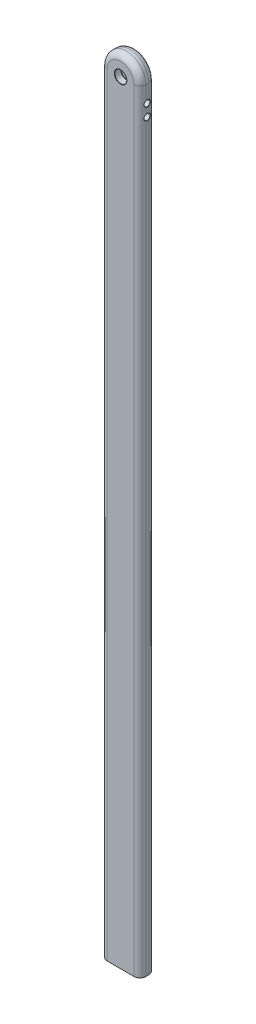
ISO-10303-21;
HEADER;
FILE_DESCRIPTION(('STEP AP214'),'2;1');
FILE_NAME('part.step','',(''),(''),'','','');
FILE_SCHEMA(('AUTOMOTIVE_DESIGN { 1 0 10303 214 1 1 1 1 }'));
ENDSEC;
DATA;
#1=APPLICATION_CONTEXT('core data for automotive mechanical design processes');
#2=APPLICATION_PROTOCOL_DEFINITION('international standard','automotive_design',2000,#1);
#3=PRODUCT_CONTEXT('',#1,'mechanical');
#4=PRODUCT('Part','Part','',(#3));
#5=PRODUCT_RELATED_PRODUCT_CATEGORY('part','',(#4));
#6=PRODUCT_DEFINITION_FORMATION('','',#4);
#7=PRODUCT_DEFINITION_CONTEXT('part definition',#1,'design');
#8=PRODUCT_DEFINITION('design','',#6,#7);
#9=PRODUCT_DEFINITION_SHAPE('','',#8);
#10=(LENGTH_UNIT() NAMED_UNIT(*) SI_UNIT(.MILLI.,.METRE.));
#11=(NAMED_UNIT(*) PLANE_ANGLE_UNIT() SI_UNIT($,.RADIAN.));
#12=(NAMED_UNIT(*) SI_UNIT($,.STERADIAN.) SOLID_ANGLE_UNIT());
#13=UNCERTAINTY_MEASURE_WITH_UNIT(LENGTH_MEASURE(1.E-05),#10,'distance_accuracy_value','');
#14=(GEOMETRIC_REPRESENTATION_CONTEXT(3) GLOBAL_UNCERTAINTY_ASSIGNED_CONTEXT((#13)) GLOBAL_UNIT_ASSIGNED_CONTEXT((#10,
#11,#12)) REPRESENTATION_CONTEXT('',''));
#15=CARTESIAN_POINT('',(0.,0.,0.));
#16=DIRECTION('',(0.,0.,1.));
#17=DIRECTION('',(1.,0.,0.));
#18=AXIS2_PLACEMENT_3D('',#15,#16,#17);
#19=CARTESIAN_POINT('',(32.4999999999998,-1297.5,12.5));
#20=DIRECTION('',(-1.,0.,0.));
#21=DIRECTION('',(0.,-1.,0.));
#22=AXIS2_PLACEMENT_3D('',#19,#20,#21);
#23=PLANE('',#22);
#24=DIRECTION('',(0.,1.,0.));
#25=VECTOR('',#24,1.);
#26=CARTESIAN_POINT('',(32.4999999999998,-1297.5,2.5));
#27=LINE('',#26,#25);
#28=CARTESIAN_POINT('',(32.5,-33.2678176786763,2.5));
#29=VERTEX_POINT('',#28);
#30=CARTESIAN_POINT('',(32.5,-43.7321823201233,2.5));
#31=VERTEX_POINT('',#30);
#32=EDGE_CURVE('E774',#29,#31,#27,.F.);
#33=ORIENTED_EDGE('',*,*,#32,.T.);
#34=CARTESIAN_POINT('',(32.5,-48.5,0.));
#35=DIRECTION('',(-1.,0.,0.));
#36=DIRECTION('',(0.,-1.,0.));
#37=AXIS2_PLACEMENT_3D('',#34,#35,#36);
#38=CIRCLE('',#37,5.3835012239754);
#39=CARTESIAN_POINT('',(32.5,-43.7321823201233,-2.5));
#40=VERTEX_POINT('',#39);
#41=EDGE_CURVE('E342',#31,#40,#38,.T.);
#42=ORIENTED_EDGE('',*,*,#41,.T.);
#43=DIRECTION('',(0.,1.,0.));
#44=VECTOR('',#43,1.);
#45=CARTESIAN_POINT('',(32.4999999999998,-1297.5,-2.5));
#46=LINE('',#45,#44);
#47=CARTESIAN_POINT('',(32.5,-33.2678176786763,-2.5));
#48=VERTEX_POINT('',#47);
#49=EDGE_CURVE('E318',#40,#48,#46,.T.);
#50=ORIENTED_EDGE('',*,*,#49,.T.);
#51=CARTESIAN_POINT('',(32.5,-28.5,0.));
#52=DIRECTION('',(-1.,0.,0.));
#53=DIRECTION('',(0.,-1.,0.));
#54=AXIS2_PLACEMENT_3D('',#51,#52,#53);
#55=CIRCLE('',#54,5.38350122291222);
#56=EDGE_CURVE('E339',#48,#29,#55,.T.);
#57=ORIENTED_EDGE('',*,*,#56,.T.);
#58=EDGE_LOOP('',(#33,#42,#50,#57));
#59=FACE_BOUND('',#58,.T.);
#60=ADVANCED_FACE('F31',(#59),#23,.F.);
#61=CARTESIAN_POINT('',(32.5,0.,2.5));
#62=VERTEX_POINT('',#61);
#63=CARTESIAN_POINT('',(32.5,-23.7321823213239,2.5));
#64=VERTEX_POINT('',#63);
#65=EDGE_CURVE('E776',#62,#64,#27,.F.);
#66=ORIENTED_EDGE('',*,*,#65,.T.);
#67=CARTESIAN_POINT('',(32.5,-28.5,0.));
#68=DIRECTION('',(-1.,0.,0.));
#69=DIRECTION('',(0.,-1.,0.));
#70=AXIS2_PLACEMENT_3D('',#67,#68,#69);
#71=CIRCLE('',#70,5.38350122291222);
#72=CARTESIAN_POINT('',(32.5,-23.7321823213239,-2.5));
#73=VERTEX_POINT('',#72);
#74=EDGE_CURVE('E436',#64,#73,#71,.T.);
#75=ORIENTED_EDGE('',*,*,#74,.T.);
#76=CARTESIAN_POINT('',(32.5,0.,-2.5));
#77=VERTEX_POINT('',#76);
#78=EDGE_CURVE('E328',#73,#77,#46,.T.);
#79=ORIENTED_EDGE('',*,*,#78,.T.);
#80=DIRECTION('',(0.,0.,-1.));
#81=VECTOR('',#80,1.);
#82=CARTESIAN_POINT('',(32.5,0.,12.5));
#83=LINE('',#82,#81);
#84=EDGE_CURVE('E186',#62,#77,#83,.T.);
#85=ORIENTED_EDGE('',*,*,#84,.F.);
#86=EDGE_LOOP('',(#66,#75,#79,#85));
#87=FACE_BOUND('',#86,.T.);
#88=ADVANCED_FACE('F743',(#87),#23,.F.);
#89=CARTESIAN_POINT('',(0.,0.,12.5));
#90=DIRECTION('',(0.,0.,-1.));
#91=DIRECTION('',(-1.,0.,0.));
#92=AXIS2_PLACEMENT_3D('',#89,#90,#91);
#93=CYLINDRICAL_SURFACE('',#92,32.5);
#94=ORIENTED_EDGE('',*,*,#84,.T.);
#95=CARTESIAN_POINT('',(0.,0.,-2.5));
#96=DIRECTION('',(0.,0.,1.));
#97=DIRECTION('',(1.,0.,0.));
#98=AXIS2_PLACEMENT_3D('',#95,#96,#97);
#99=CIRCLE('',#98,32.5);
#100=CARTESIAN_POINT('',(-32.5,0.,-2.5));
#101=VERTEX_POINT('',#100);
#102=EDGE_CURVE('E185',#77,#101,#99,.T.);
#103=ORIENTED_EDGE('',*,*,#102,.T.);
#104=DIRECTION('',(0.,0.,-1.));
#105=VECTOR('',#104,1.);
#106=CARTESIAN_POINT('',(-32.5,0.,12.5));
#107=LINE('',#106,#105);
#108=CARTESIAN_POINT('',(-32.5,0.,2.5));
#109=VERTEX_POINT('',#108);
#110=EDGE_CURVE('E171',#109,#101,#107,.T.);
#111=ORIENTED_EDGE('',*,*,#110,.F.);
#112=CARTESIAN_POINT('',(0.,0.,2.5));
#113=DIRECTION('',(0.,0.,1.));
#114=DIRECTION('',(1.,0.,0.));
#115=AXIS2_PLACEMENT_3D('',#112,#113,#114);
#116=CIRCLE('',#115,32.5);
#117=EDGE_CURVE('E182',#109,#62,#116,.F.);
#118=ORIENTED_EDGE('',*,*,#117,.T.);
#119=EDGE_LOOP('',(#94,#103,#111,#118));
#120=FACE_BOUND('',#119,.T.);
#121=ADVANCED_FACE('F181',(#120),#93,.T.);
#122=CARTESIAN_POINT('',(-32.5,0.,12.5));
#123=DIRECTION('',(1.,0.,0.));
#124=DIRECTION('',(0.,1.,0.));
#125=AXIS2_PLACEMENT_3D('',#122,#123,#124);
#126=PLANE('',#125);
#127=DIRECTION('',(0.,-1.,0.));
#128=VECTOR('',#127,1.);
#129=CARTESIAN_POINT('',(-32.5,0.,-2.5));
#130=LINE('',#129,#128);
#131=CARTESIAN_POINT('',(-32.4999999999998,-1297.,-2.5));
#132=VERTEX_POINT('',#131);
#133=EDGE_CURVE('E176',#101,#132,#130,.T.);
#134=ORIENTED_EDGE('',*,*,#133,.T.);
#135=DIRECTION('',(0.,0.,1.));
#136=VECTOR('',#135,1.);
#137=CARTESIAN_POINT('',(-32.4999999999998,-1297.,12.5));
#138=LINE('',#137,#136);
#139=CARTESIAN_POINT('',(-32.4999999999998,-1297.,2.5));
#140=VERTEX_POINT('',#139);
#141=EDGE_CURVE('E40',#132,#140,#138,.T.);
#142=ORIENTED_EDGE('',*,*,#141,.T.);
#143=DIRECTION('',(0.,-1.,0.));
#144=VECTOR('',#143,1.);
#145=CARTESIAN_POINT('',(-32.5,0.,2.5));
#146=LINE('',#145,#144);
#147=EDGE_CURVE('E168',#140,#109,#146,.F.);
#148=ORIENTED_EDGE('',*,*,#147,.T.);
#149=ORIENTED_EDGE('',*,*,#110,.T.);
#150=EDGE_LOOP('',(#134,#142,#148,#149));
#151=FACE_BOUND('',#150,.T.);
#152=ADVANCED_FACE('F170',(#151),#126,.F.);
#153=CARTESIAN_POINT('',(-32.4999999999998,-1297.5,12.5));
#154=DIRECTION('',(0.,1.,0.));
#155=DIRECTION('',(0.,0.,1.));
#156=AXIS2_PLACEMENT_3D('',#153,#154,#155);
#157=PLANE('',#156);
#158=CARTESIAN_POINT('',(19.,-1297.5,0.));
#159=DIRECTION('',(0.,1.,0.));
#160=DIRECTION('',(0.,0.,1.));
#161=AXIS2_PLACEMENT_3D('',#158,#159,#160);
#162=CIRCLE('',#161,5.49999999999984);
#163=CARTESIAN_POINT('',(19.,-1297.5,5.49999999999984));
#164=VERTEX_POINT('',#163);
#165=EDGE_CURVE('E242',#164,#164,#162,.T.);
#166=ORIENTED_EDGE('',*,*,#165,.T.);
#167=EDGE_LOOP('',(#166));
#168=FACE_BOUND('',#167,.T.);
#169=CARTESIAN_POINT('',(0.,-1297.5,0.));
#170=DIRECTION('',(0.,1.,0.));
#171=DIRECTION('',(0.,0.,1.));
#172=AXIS2_PLACEMENT_3D('',#169,#170,#171);
#173=CIRCLE('',#172,5.49999999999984);
#174=CARTESIAN_POINT('',(0.,-1297.5,5.49999999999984));
#175=VERTEX_POINT('',#174);
#176=EDGE_CURVE('E239',#175,#175,#173,.T.);
#177=ORIENTED_EDGE('',*,*,#176,.T.);
#178=EDGE_LOOP('',(#177));
#179=FACE_BOUND('',#178,.T.);
#180=CARTESIAN_POINT('',(-19.,-1297.5,0.));
#181=DIRECTION('',(0.,1.,0.));
#182=DIRECTION('',(0.,0.,1.));
#183=AXIS2_PLACEMENT_3D('',#180,#181,#182);
#184=CIRCLE('',#183,5.49999999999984);
#185=CARTESIAN_POINT('',(-19.,-1297.5,5.49999999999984));
#186=VERTEX_POINT('',#185);
#187=EDGE_CURVE('E236',#186,#186,#184,.T.);
#188=ORIENTED_EDGE('',*,*,#187,.T.);
#189=EDGE_LOOP('',(#188));
#190=FACE_BOUND('',#189,.T.);
#191=CARTESIAN_POINT('',(-22.4999999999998,-1297.5,-2.5));
#192=DIRECTION('',(0.,1.,0.));
#193=DIRECTION('',(0.,0.,1.));
#194=AXIS2_PLACEMENT_3D('',#191,#192,#193);
#195=CIRCLE('',#194,9.49999999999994);
#196=CARTESIAN_POINT('',(-31.9999999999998,-1297.5,-2.5));
#197=VERTEX_POINT('',#196);
#198=CARTESIAN_POINT('',(-22.4999999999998,-1297.5,-11.9999999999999));
#199=VERTEX_POINT('',#198);
#200=EDGE_CURVE('E231',#197,#199,#195,.F.);
#201=ORIENTED_EDGE('',*,*,#200,.T.);
#202=DIRECTION('',(1.,0.,0.));
#203=VECTOR('',#202,1.);
#204=CARTESIAN_POINT('',(-32.4999999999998,-1297.5,-11.9999999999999));
#205=LINE('',#204,#203);
#206=CARTESIAN_POINT('',(22.4999999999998,-1297.5,-11.9999999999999));
#207=VERTEX_POINT('',#206);
#208=EDGE_CURVE('E233',#199,#207,#205,.T.);
#209=ORIENTED_EDGE('',*,*,#208,.T.);
#210=CARTESIAN_POINT('',(22.4999999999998,-1297.5,-2.5));
#211=DIRECTION('',(0.,1.,0.));
#212=DIRECTION('',(0.,0.,1.));
#213=AXIS2_PLACEMENT_3D('',#210,#211,#212);
#214=CIRCLE('',#213,9.49999999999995);
#215=CARTESIAN_POINT('',(31.9999999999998,-1297.5,-2.5));
#216=VERTEX_POINT('',#215);
#217=EDGE_CURVE('E229',#207,#216,#214,.F.);
#218=ORIENTED_EDGE('',*,*,#217,.T.);
#219=DIRECTION('',(0.,0.,1.));
#220=VECTOR('',#219,1.);
#221=CARTESIAN_POINT('',(31.9999999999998,-1297.5,12.5));
#222=LINE('',#221,#220);
#223=CARTESIAN_POINT('',(31.9999999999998,-1297.5,2.5));
#224=VERTEX_POINT('',#223);
#225=EDGE_CURVE('E225',#216,#224,#222,.T.);
#226=ORIENTED_EDGE('',*,*,#225,.T.);
#227=CARTESIAN_POINT('',(22.4999999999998,-1297.5,2.5));
#228=DIRECTION('',(0.,1.,0.));
#229=DIRECTION('',(0.,0.,1.));
#230=AXIS2_PLACEMENT_3D('',#227,#228,#229);
#231=CIRCLE('',#230,9.49999999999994);
#232=CARTESIAN_POINT('',(22.4999999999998,-1297.5,11.9999999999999));
#233=VERTEX_POINT('',#232);
#234=EDGE_CURVE('E221',#224,#233,#231,.F.);
#235=ORIENTED_EDGE('',*,*,#234,.T.);
#236=DIRECTION('',(-1.,0.,0.));
#237=VECTOR('',#236,1.);
#238=CARTESIAN_POINT('',(-22.4999999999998,-1297.5,11.9999999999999));
#239=LINE('',#238,#237);
#240=CARTESIAN_POINT('',(-22.4999999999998,-1297.5,11.9999999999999));
#241=VERTEX_POINT('',#240);
#242=EDGE_CURVE('E219',#233,#241,#239,.T.);
#243=ORIENTED_EDGE('',*,*,#242,.T.);
#244=CARTESIAN_POINT('',(-22.4999999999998,-1297.5,2.5));
#245=DIRECTION('',(0.,1.,0.));
#246=DIRECTION('',(0.,0.,1.));
#247=AXIS2_PLACEMENT_3D('',#244,#245,#246);
#248=CIRCLE('',#247,9.49999999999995);
#249=CARTESIAN_POINT('',(-31.9999999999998,-1297.5,2.5));
#250=VERTEX_POINT('',#249);
#251=EDGE_CURVE('E223',#241,#250,#248,.F.);
#252=ORIENTED_EDGE('',*,*,#251,.T.);
#253=DIRECTION('',(0.,0.,-1.));
#254=VECTOR('',#253,1.);
#255=CARTESIAN_POINT('',(-31.9999999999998,-1297.5,12.5));
#256=LINE('',#255,#254);
#257=EDGE_CURVE('E227',#250,#197,#256,.T.);
#258=ORIENTED_EDGE('',*,*,#257,.T.);
#259=EDGE_LOOP('',(#201,#209,#218,#226,#235,#243,#252,#258));
#260=FACE_BOUND('',#259,.T.);
#261=ADVANCED_FACE('F754',(#168,#179,#190,#260),#157,.F.);
#262=CARTESIAN_POINT('',(32.4999999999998,-1297.,-2.5));
#263=VERTEX_POINT('',#262);
#264=CARTESIAN_POINT('',(32.5,-53.2678176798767,-2.5));
#265=VERTEX_POINT('',#264);
#266=EDGE_CURVE('E216',#263,#265,#46,.T.);
#267=ORIENTED_EDGE('',*,*,#266,.T.);
#268=CARTESIAN_POINT('',(32.5,-48.5,0.));
#269=DIRECTION('',(-1.,0.,0.));
#270=DIRECTION('',(0.,-1.,0.));
#271=AXIS2_PLACEMENT_3D('',#268,#269,#270);
#272=CIRCLE('',#271,5.3835012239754);
#273=CARTESIAN_POINT('',(32.5,-53.2678176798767,2.5));
#274=VERTEX_POINT('',#273);
#275=EDGE_CURVE('E764',#265,#274,#272,.T.);
#276=ORIENTED_EDGE('',*,*,#275,.T.);
#277=CARTESIAN_POINT('',(32.4999999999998,-1297.,2.5));
#278=VERTEX_POINT('',#277);
#279=EDGE_CURVE('E319',#274,#278,#27,.F.);
#280=ORIENTED_EDGE('',*,*,#279,.T.);
#281=DIRECTION('',(0.,0.,-1.));
#282=VECTOR('',#281,1.);
#283=CARTESIAN_POINT('',(32.4999999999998,-1297.,12.5));
#284=LINE('',#283,#282);
#285=EDGE_CURVE('E314',#278,#263,#284,.T.);
#286=ORIENTED_EDGE('',*,*,#285,.T.);
#287=EDGE_LOOP('',(#267,#276,#280,#286));
#288=FACE_BOUND('',#287,.T.);
#289=ADVANCED_FACE('F745',(#288),#23,.F.);
#290=CARTESIAN_POINT('',(0.,0.,12.5));
#291=DIRECTION('',(0.,0.,1.));
#292=DIRECTION('',(1.,0.,0.));
#293=AXIS2_PLACEMENT_3D('',#290,#291,#292);
#294=PLANE('',#293);
#295=CARTESIAN_POINT('',(0.,0.,12.5));
#296=DIRECTION('',(0.,0.,1.));
#297=DIRECTION('',(1.,0.,0.));
#298=AXIS2_PLACEMENT_3D('',#295,#296,#297);
#299=CIRCLE('',#298,10.5000000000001);
#300=CARTESIAN_POINT('',(10.5000000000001,0.,12.5));
#301=VERTEX_POINT('',#300);
#302=EDGE_CURVE('E448',#301,#301,#299,.F.);
#303=ORIENTED_EDGE('',*,*,#302,.T.);
#304=EDGE_LOOP('',(#303));
#305=FACE_BOUND('',#304,.T.);
#306=DIRECTION('',(0.,-1.,0.));
#307=VECTOR('',#306,1.);
#308=CARTESIAN_POINT('',(-22.4999999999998,-1297.5,12.5));
#309=LINE('',#308,#307);
#310=CARTESIAN_POINT('',(-22.5,0.,12.5));
#311=VERTEX_POINT('',#310);
#312=CARTESIAN_POINT('',(-22.4999999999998,-1297.,12.5));
#313=VERTEX_POINT('',#312);
#314=EDGE_CURVE('E201',#311,#313,#309,.T.);
#315=ORIENTED_EDGE('',*,*,#314,.T.);
#316=DIRECTION('',(1.,0.,0.));
#317=VECTOR('',#316,1.);
#318=CARTESIAN_POINT('',(22.4999999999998,-1297.,12.5));
#319=LINE('',#318,#317);
#320=CARTESIAN_POINT('',(22.4999999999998,-1297.,12.5));
#321=VERTEX_POINT('',#320);
#322=EDGE_CURVE('E446',#313,#321,#319,.T.);
#323=ORIENTED_EDGE('',*,*,#322,.T.);
#324=DIRECTION('',(0.,1.,0.));
#325=VECTOR('',#324,1.);
#326=CARTESIAN_POINT('',(22.5,0.,12.5));
#327=LINE('',#326,#325);
#328=CARTESIAN_POINT('',(22.5,0.,12.5));
#329=VERTEX_POINT('',#328);
#330=EDGE_CURVE('E894',#321,#329,#327,.T.);
#331=ORIENTED_EDGE('',*,*,#330,.T.);
#332=CARTESIAN_POINT('',(0.,0.,12.5));
#333=DIRECTION('',(0.,0.,1.));
#334=DIRECTION('',(1.,0.,0.));
#335=AXIS2_PLACEMENT_3D('',#332,#333,#334);
#336=CIRCLE('',#335,22.5);
#337=EDGE_CURVE('E889',#329,#311,#336,.T.);
#338=ORIENTED_EDGE('',*,*,#337,.T.);
#339=EDGE_LOOP('',(#315,#323,#331,#338));
#340=FACE_BOUND('',#339,.T.);
#341=ADVANCED_FACE('F753',(#305,#340),#294,.T.);
#342=CARTESIAN_POINT('',(0.,0.,-12.5));
#343=DIRECTION('',(0.,0.,1.));
#344=DIRECTION('',(1.,0.,0.));
#345=AXIS2_PLACEMENT_3D('',#342,#343,#344);
#346=PLANE('',#345);
#347=DIRECTION('',(0.,1.,0.));
#348=VECTOR('',#347,1.);
#349=CARTESIAN_POINT('',(22.5,0.,-12.5));
#350=LINE('',#349,#348);
#351=CARTESIAN_POINT('',(22.5,0.,-12.5));
#352=VERTEX_POINT('',#351);
#353=CARTESIAN_POINT('',(22.4999999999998,-1297.,-12.5));
#354=VERTEX_POINT('',#353);
#355=EDGE_CURVE('E860',#352,#354,#350,.F.);
#356=ORIENTED_EDGE('',*,*,#355,.T.);
#357=DIRECTION('',(-1.,0.,0.));
#358=VECTOR('',#357,1.);
#359=CARTESIAN_POINT('',(0.,-1297.,-12.5));
#360=LINE('',#359,#358);
#361=CARTESIAN_POINT('',(-22.4999999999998,-1297.,-12.5));
#362=VERTEX_POINT('',#361);
#363=EDGE_CURVE('E454',#354,#362,#360,.T.);
#364=ORIENTED_EDGE('',*,*,#363,.T.);
#365=DIRECTION('',(0.,-1.,0.));
#366=VECTOR('',#365,1.);
#367=CARTESIAN_POINT('',(-22.5,0.,-12.5));
#368=LINE('',#367,#366);
#369=CARTESIAN_POINT('',(-22.5,0.,-12.5));
#370=VERTEX_POINT('',#369);
#371=EDGE_CURVE('E197',#362,#370,#368,.F.);
#372=ORIENTED_EDGE('',*,*,#371,.T.);
#373=CARTESIAN_POINT('',(0.,0.,-12.5));
#374=DIRECTION('',(0.,0.,1.));
#375=DIRECTION('',(1.,0.,0.));
#376=AXIS2_PLACEMENT_3D('',#373,#374,#375);
#377=CIRCLE('',#376,22.5);
#378=EDGE_CURVE('E863',#370,#352,#377,.F.);
#379=ORIENTED_EDGE('',*,*,#378,.T.);
#380=EDGE_LOOP('',(#356,#364,#372,#379));
#381=FACE_BOUND('',#380,.T.);
#382=ADVANCED_FACE('F379',(#381),#346,.F.);
#383=CARTESIAN_POINT('',(22.4999999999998,-1297.5,-2.5));
#384=DIRECTION('',(0.,1.,0.));
#385=DIRECTION('',(-1.,0.,0.));
#386=AXIS2_PLACEMENT_3D('',#383,#384,#385);
#387=CYLINDRICAL_SURFACE('',#386,10.);
#388=ORIENTED_EDGE('',*,*,#49,.F.);
#389=CARTESIAN_POINT('',(32.5,-53.2678176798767,-2.49999999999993));
#390=CARTESIAN_POINT('',(32.4999429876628,-52.8065514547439,-3.40451116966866));
#391=CARTESIAN_POINT('',(32.3776324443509,-52.1139789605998,-4.15352355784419));
#392=CARTESIAN_POINT('',(32.1449124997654,-50.4498451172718,-5.19046526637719));
#393=CARTESIAN_POINT('',(32.0484820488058,-49.477532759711,-5.47097156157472));
#394=CARTESIAN_POINT('',(32.049314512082,-47.5175301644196,-5.46823432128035));
#395=CARTESIAN_POINT('',(32.1458730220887,-46.5441951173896,-5.18667730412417));
#396=CARTESIAN_POINT('',(32.3786100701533,-44.8779774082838,-4.14859200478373));
#397=CARTESIAN_POINT('',(32.5008169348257,-44.1852356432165,-3.39432808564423));
#398=CARTESIAN_POINT('',(32.5,-43.7321823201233,-2.5));
#399=B_SPLINE_CURVE_WITH_KNOTS('',3,(#389,#390,#391,#392,#393,#394,#395,#396,#397,#398),
.UNSPECIFIED.,.F.,.F.,(4,2,2,2,4),(0.,0.00292158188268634,0.00584316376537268,
0.00876474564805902,0.0116863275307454),.UNSPECIFIED.);
#400=EDGE_CURVE('E358',#40,#265,#399,.F.);
#401=ORIENTED_EDGE('',*,*,#400,.T.);
#402=ORIENTED_EDGE('',*,*,#266,.F.);
#403=CARTESIAN_POINT('',(22.4999999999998,-1297.,-2.5));
#404=DIRECTION('',(0.,1.,0.));
#405=DIRECTION('',(0.,0.,1.));
#406=AXIS2_PLACEMENT_3D('',#403,#404,#405);
#407=CIRCLE('',#406,10.);
#408=EDGE_CURVE('E346',#263,#354,#407,.T.);
#409=ORIENTED_EDGE('',*,*,#408,.T.);
#410=ORIENTED_EDGE('',*,*,#355,.F.);
#411=CARTESIAN_POINT('',(22.5,0.,-2.5));
#412=DIRECTION('',(0.,1.,0.));
#413=DIRECTION('',(0.,0.,1.));
#414=AXIS2_PLACEMENT_3D('',#411,#412,#413);
#415=CIRCLE('',#414,10.);
#416=EDGE_CURVE('E209',#77,#352,#415,.T.);
#417=ORIENTED_EDGE('',*,*,#416,.F.);
#418=ORIENTED_EDGE('',*,*,#78,.F.);
#419=CARTESIAN_POINT('',(32.5,-33.2678176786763,-2.50000000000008));
#420=CARTESIAN_POINT('',(32.4999429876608,-32.8065514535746,-3.40451116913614));
#421=CARTESIAN_POINT('',(32.3776324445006,-32.1139789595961,-4.15352355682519));
#422=CARTESIAN_POINT('',(32.1449125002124,-30.4498451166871,-5.19046526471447));
#423=CARTESIAN_POINT('',(32.048482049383,-29.4775327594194,-5.47097155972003));
#424=CARTESIAN_POINT('',(32.0493145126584,-27.5175301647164,-5.46823431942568));
#425=CARTESIAN_POINT('',(32.1458730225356,-26.5441951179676,-5.18667730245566));
#426=CARTESIAN_POINT('',(32.3786100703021,-24.8779774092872,-4.14859200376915));
#427=CARTESIAN_POINT('',(32.5008169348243,-24.1852356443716,-3.39432808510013));
#428=CARTESIAN_POINT('',(32.5,-23.7321823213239,-2.5));
#429=B_SPLINE_CURVE_WITH_KNOTS('',3,(#419,#420,#421,#422,#423,#424,#425,#426,#427,#428),
.UNSPECIFIED.,.F.,.F.,(4,2,2,2,4),(0.,0.00292158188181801,0.00584316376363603,
0.00876474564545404,0.0116863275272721),.UNSPECIFIED.);
#430=EDGE_CURVE('E352',#73,#48,#429,.F.);
#431=ORIENTED_EDGE('',*,*,#430,.T.);
#432=EDGE_LOOP('',(#388,#401,#402,#409,#410,#417,#418,#431));
#433=FACE_BOUND('',#432,.T.);
#434=ADVANCED_FACE('F368',(#433),#387,.T.);
#435=CARTESIAN_POINT('',(0.,0.,-2.5));
#436=DIRECTION('',(0.,0.,1.));
#437=DIRECTION('',(1.,0.,0.));
#438=AXIS2_PLACEMENT_3D('',#435,#436,#437);
#439=TOROIDAL_SURFACE('',#438,22.5,10.);
#440=ORIENTED_EDGE('',*,*,#416,.T.);
#441=ORIENTED_EDGE('',*,*,#378,.F.);
#442=CARTESIAN_POINT('',(-22.5,0.,-2.5));
#443=DIRECTION('',(0.,-1.,0.));
#444=DIRECTION('',(0.,0.,-1.));
#445=AXIS2_PLACEMENT_3D('',#442,#443,#444);
#446=CIRCLE('',#445,10.);
#447=EDGE_CURVE('E204',#101,#370,#446,.T.);
#448=ORIENTED_EDGE('',*,*,#447,.F.);
#449=ORIENTED_EDGE('',*,*,#102,.F.);
#450=EDGE_LOOP('',(#440,#441,#448,#449));
#451=FACE_BOUND('',#450,.T.);
#452=ADVANCED_FACE('F378',(#451),#439,.T.);
#453=CARTESIAN_POINT('',(-22.5,0.,-2.5));
#454=DIRECTION('',(0.,-1.,0.));
#455=DIRECTION('',(1.,0.,0.));
#456=AXIS2_PLACEMENT_3D('',#453,#454,#455);
#457=CYLINDRICAL_SURFACE('',#456,10.);
#458=ORIENTED_EDGE('',*,*,#371,.F.);
#459=CARTESIAN_POINT('',(-22.4999999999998,-1297.,-2.5));
#460=DIRECTION('',(0.,1.,0.));
#461=DIRECTION('',(0.,0.,1.));
#462=AXIS2_PLACEMENT_3D('',#459,#460,#461);
#463=CIRCLE('',#462,10.);
#464=EDGE_CURVE('E55',#362,#132,#463,.T.);
#465=ORIENTED_EDGE('',*,*,#464,.T.);
#466=ORIENTED_EDGE('',*,*,#133,.F.);
#467=ORIENTED_EDGE('',*,*,#447,.T.);
#468=EDGE_LOOP('',(#458,#465,#466,#467));
#469=FACE_BOUND('',#468,.T.);
#470=ADVANCED_FACE('F794',(#469),#457,.T.);
#471=CARTESIAN_POINT('',(22.5,0.,2.5));
#472=DIRECTION('',(0.,-1.,0.));
#473=DIRECTION('',(1.,0.,0.));
#474=AXIS2_PLACEMENT_3D('',#471,#472,#473);
#475=CYLINDRICAL_SURFACE('',#474,10.);
#476=ORIENTED_EDGE('',*,*,#279,.F.);
#477=CARTESIAN_POINT('',(32.5,-43.7321823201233,2.5));
#478=CARTESIAN_POINT('',(32.4999429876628,-44.1934485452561,3.40451116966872));
#479=CARTESIAN_POINT('',(32.3776324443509,-44.8860210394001,4.15352355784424));
#480=CARTESIAN_POINT('',(32.1449124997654,-46.5501548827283,5.19046526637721));
#481=CARTESIAN_POINT('',(32.0484820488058,-47.5224672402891,5.47097156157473));
#482=CARTESIAN_POINT('',(32.049314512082,-49.4824698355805,5.46823432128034));
#483=CARTESIAN_POINT('',(32.1458730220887,-50.4558048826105,5.18667730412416));
#484=CARTESIAN_POINT('',(32.3786100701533,-52.122022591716,4.14859200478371));
#485=CARTESIAN_POINT('',(32.5008169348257,-52.8147643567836,3.39432808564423));
#486=CARTESIAN_POINT('',(32.5,-53.2678176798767,2.5));
#487=B_SPLINE_CURVE_WITH_KNOTS('',3,(#477,#478,#479,#480,#481,#482,#483,#484,#485,#486),
.UNSPECIFIED.,.F.,.F.,(4,2,2,2,4),(0.,0.00292158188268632,0.00584316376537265,
0.00876474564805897,0.0116863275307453),.UNSPECIFIED.);
#488=EDGE_CURVE('E343',#274,#31,#487,.F.);
#489=ORIENTED_EDGE('',*,*,#488,.T.);
#490=ORIENTED_EDGE('',*,*,#32,.F.);
#491=CARTESIAN_POINT('',(32.5,-23.7321823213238,2.50000000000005));
#492=CARTESIAN_POINT('',(32.4999429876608,-24.1934485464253,3.40451116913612));
#493=CARTESIAN_POINT('',(32.3776324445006,-24.8860210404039,4.15352355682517));
#494=CARTESIAN_POINT('',(32.1449125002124,-26.5501548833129,5.19046526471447));
#495=CARTESIAN_POINT('',(32.048482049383,-27.5224672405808,5.47097155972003));
#496=CARTESIAN_POINT('',(32.0493145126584,-29.4824698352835,5.46823431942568));
#497=CARTESIAN_POINT('',(32.1458730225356,-30.4558048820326,5.18667730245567));
#498=CARTESIAN_POINT('',(32.3786100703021,-32.1220225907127,4.14859200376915));
#499=CARTESIAN_POINT('',(32.5008169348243,-32.8147643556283,3.39432808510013));
#500=CARTESIAN_POINT('',(32.5,-33.2678176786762,2.5));
#501=B_SPLINE_CURVE_WITH_KNOTS('',3,(#491,#492,#493,#494,#495,#496,#497,#498,#499,#500),
.UNSPECIFIED.,.F.,.F.,(4,2,2,2,4),(0.,0.00292158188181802,0.00584316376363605,
0.00876474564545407,0.0116863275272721),.UNSPECIFIED.);
#502=EDGE_CURVE('E665',#29,#64,#501,.F.);
#503=ORIENTED_EDGE('',*,*,#502,.T.);
#504=ORIENTED_EDGE('',*,*,#65,.F.);
#505=CARTESIAN_POINT('',(22.5,0.,2.5));
#506=DIRECTION('',(0.,1.,0.));
#507=DIRECTION('',(0.,0.,1.));
#508=AXIS2_PLACEMENT_3D('',#505,#506,#507);
#509=CIRCLE('',#508,10.);
#510=EDGE_CURVE('E196',#329,#62,#509,.T.);
#511=ORIENTED_EDGE('',*,*,#510,.F.);
#512=ORIENTED_EDGE('',*,*,#330,.F.);
#513=CARTESIAN_POINT('',(22.4999999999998,-1297.,2.5));
#514=DIRECTION('',(0.,1.,0.));
#515=DIRECTION('',(0.,0.,1.));
#516=AXIS2_PLACEMENT_3D('',#513,#514,#515);
#517=CIRCLE('',#516,10.);
#518=EDGE_CURVE('E768',#321,#278,#517,.T.);
#519=ORIENTED_EDGE('',*,*,#518,.T.);
#520=EDGE_LOOP('',(#476,#489,#490,#503,#504,#511,#512,#519));
#521=FACE_BOUND('',#520,.T.);
#522=ADVANCED_FACE('F785',(#521),#475,.T.);
#523=CARTESIAN_POINT('',(0.,0.,2.5));
#524=DIRECTION('',(0.,0.,1.));
#525=DIRECTION('',(1.,0.,0.));
#526=AXIS2_PLACEMENT_3D('',#523,#524,#525);
#527=TOROIDAL_SURFACE('',#526,22.5,10.);
#528=ORIENTED_EDGE('',*,*,#510,.T.);
#529=ORIENTED_EDGE('',*,*,#117,.F.);
#530=CARTESIAN_POINT('',(-22.5,0.,2.5));
#531=DIRECTION('',(0.,-1.,0.));
#532=DIRECTION('',(1.,0.,0.));
#533=AXIS2_PLACEMENT_3D('',#530,#531,#532);
#534=CIRCLE('',#533,10.);
#535=EDGE_CURVE('E193',#311,#109,#534,.T.);
#536=ORIENTED_EDGE('',*,*,#535,.F.);
#537=ORIENTED_EDGE('',*,*,#337,.F.);
#538=EDGE_LOOP('',(#528,#529,#536,#537));
#539=FACE_BOUND('',#538,.T.);
#540=ADVANCED_FACE('F191',(#539),#527,.T.);
#541=CARTESIAN_POINT('',(-22.5,0.,2.5));
#542=DIRECTION('',(0.,1.,0.));
#543=DIRECTION('',(-1.,0.,0.));
#544=AXIS2_PLACEMENT_3D('',#541,#542,#543);
#545=CYLINDRICAL_SURFACE('',#544,10.);
#546=ORIENTED_EDGE('',*,*,#147,.F.);
#547=CARTESIAN_POINT('',(-22.4999999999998,-1297.,2.5));
#548=DIRECTION('',(0.,1.,0.));
#549=DIRECTION('',(0.,0.,1.));
#550=AXIS2_PLACEMENT_3D('',#547,#548,#549);
#551=CIRCLE('',#550,10.);
#552=EDGE_CURVE('E11',#140,#313,#551,.T.);
#553=ORIENTED_EDGE('',*,*,#552,.T.);
#554=ORIENTED_EDGE('',*,*,#314,.F.);
#555=ORIENTED_EDGE('',*,*,#535,.T.);
#556=EDGE_LOOP('',(#546,#553,#554,#555));
#557=FACE_BOUND('',#556,.T.);
#558=ADVANCED_FACE('F199',(#557),#545,.T.);
#559=CARTESIAN_POINT('',(0.,0.,1.5));
#560=DIRECTION('',(0.,0.,1.));
#561=DIRECTION('',(1.,0.,0.));
#562=AXIS2_PLACEMENT_3D('',#559,#560,#561);
#563=CYLINDRICAL_SURFACE('',#562,10.);
#564=CARTESIAN_POINT('',(0.,0.,11.9999999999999));
#565=DIRECTION('',(0.,0.,1.));
#566=DIRECTION('',(1.,0.,0.));
#567=AXIS2_PLACEMENT_3D('',#564,#565,#566);
#568=CIRCLE('',#567,10.);
#569=CARTESIAN_POINT('',(10.,0.,11.9999999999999));
#570=VERTEX_POINT('',#569);
#571=EDGE_CURVE('E443',#570,#570,#568,.T.);
#572=ORIENTED_EDGE('',*,*,#571,.T.);
#573=EDGE_LOOP('',(#572));
#574=FACE_BOUND('',#573,.T.);
#575=CARTESIAN_POINT('',(0.,0.,2.00000000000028));
#576=DIRECTION('',(0.,0.,1.));
#577=DIRECTION('',(1.,0.,0.));
#578=AXIS2_PLACEMENT_3D('',#575,#576,#577);
#579=CIRCLE('',#578,10.);
#580=CARTESIAN_POINT('',(10.,0.,2.00000000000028));
#581=VERTEX_POINT('',#580);
#582=EDGE_CURVE('E438',#581,#581,#579,.F.);
#583=ORIENTED_EDGE('',*,*,#582,.T.);
#584=EDGE_LOOP('',(#583));
#585=FACE_BOUND('',#584,.T.);
#586=ADVANCED_FACE('F852',(#574,#585),#563,.F.);
#587=CARTESIAN_POINT('',(0.,0.,1.5));
#588=DIRECTION('',(0.,0.,1.));
#589=DIRECTION('',(1.,0.,0.));
#590=AXIS2_PLACEMENT_3D('',#587,#588,#589);
#591=PLANE('',#590);
#592=CARTESIAN_POINT('',(0.,0.,1.5));
#593=DIRECTION('',(0.,0.,1.));
#594=DIRECTION('',(1.,0.,0.));
#595=AXIS2_PLACEMENT_3D('',#592,#593,#594);
#596=CIRCLE('',#595,9.49999999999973);
#597=CARTESIAN_POINT('',(9.49999999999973,0.,1.5));
#598=VERTEX_POINT('',#597);
#599=EDGE_CURVE('E451',#598,#598,#596,.T.);
#600=ORIENTED_EDGE('',*,*,#599,.T.);
#601=EDGE_LOOP('',(#600));
#602=FACE_BOUND('',#601,.T.);
#603=ADVANCED_FACE('F848',(#602),#591,.T.);
#604=CARTESIAN_POINT('',(0.,-1262.5,0.));
#605=DIRECTION('',(0.,-1.,0.));
#606=DIRECTION('',(0.,0.,-1.));
#607=AXIS2_PLACEMENT_3D('',#604,#605,#606);
#608=CYLINDRICAL_SURFACE('',#607,5.);
#609=CARTESIAN_POINT('',(0.,-1297.,0.));
#610=DIRECTION('',(0.,1.,0.));
#611=DIRECTION('',(0.,0.,1.));
#612=AXIS2_PLACEMENT_3D('',#609,#610,#611);
#613=CIRCLE('',#612,5.);
#614=CARTESIAN_POINT('',(0.,-1297.,5.));
#615=VERTEX_POINT('',#614);
#616=EDGE_CURVE('E251',#615,#615,#613,.F.);
#617=ORIENTED_EDGE('',*,*,#616,.T.);
#618=EDGE_LOOP('',(#617));
#619=FACE_BOUND('',#618,.T.);
#620=CARTESIAN_POINT('',(0.,-1263.,0.));
#621=DIRECTION('',(0.,-1.,0.));
#622=DIRECTION('',(0.,0.,-1.));
#623=AXIS2_PLACEMENT_3D('',#620,#621,#622);
#624=CIRCLE('',#623,5.);
#625=CARTESIAN_POINT('',(0.,-1263.,-5.));
#626=VERTEX_POINT('',#625);
#627=EDGE_CURVE('E248',#626,#626,#624,.F.);
#628=ORIENTED_EDGE('',*,*,#627,.T.);
#629=EDGE_LOOP('',(#628));
#630=FACE_BOUND('',#629,.T.);
#631=ADVANCED_FACE('F844',(#619,#630),#608,.F.);
#632=CARTESIAN_POINT('',(0.,-1262.5,0.));
#633=DIRECTION('',(0.,-1.,0.));
#634=DIRECTION('',(0.,0.,-1.));
#635=AXIS2_PLACEMENT_3D('',#632,#633,#634);
#636=PLANE('',#635);
#637=CARTESIAN_POINT('',(0.,-1262.5,0.));
#638=DIRECTION('',(0.,-1.,0.));
#639=DIRECTION('',(0.,0.,-1.));
#640=AXIS2_PLACEMENT_3D('',#637,#638,#639);
#641=CIRCLE('',#640,4.50000000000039);
#642=CARTESIAN_POINT('',(0.,-1262.5,-4.50000000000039));
#643=VERTEX_POINT('',#642);
#644=EDGE_CURVE('E254',#643,#643,#641,.T.);
#645=ORIENTED_EDGE('',*,*,#644,.T.);
#646=EDGE_LOOP('',(#645));
#647=FACE_BOUND('',#646,.T.);
#648=ADVANCED_FACE('F840',(#647),#636,.T.);
#649=CARTESIAN_POINT('',(19.,-1262.5,0.));
#650=DIRECTION('',(0.,-1.,0.));
#651=DIRECTION('',(0.,0.,-1.));
#652=AXIS2_PLACEMENT_3D('',#649,#650,#651);
#653=CYLINDRICAL_SURFACE('',#652,5.);
#654=CARTESIAN_POINT('',(19.,-1297.,0.));
#655=DIRECTION('',(0.,1.,0.));
#656=DIRECTION('',(0.,0.,1.));
#657=AXIS2_PLACEMENT_3D('',#654,#655,#656);
#658=CIRCLE('',#657,5.);
#659=CARTESIAN_POINT('',(19.,-1297.,5.));
#660=VERTEX_POINT('',#659);
#661=EDGE_CURVE('E215',#660,#660,#658,.F.);
#662=ORIENTED_EDGE('',*,*,#661,.T.);
#663=EDGE_LOOP('',(#662));
#664=FACE_BOUND('',#663,.T.);
#665=CARTESIAN_POINT('',(19.,-1263.,0.));
#666=DIRECTION('',(0.,-1.,0.));
#667=DIRECTION('',(0.,0.,-1.));
#668=AXIS2_PLACEMENT_3D('',#665,#666,#667);
#669=CIRCLE('',#668,5.);
#670=CARTESIAN_POINT('',(19.,-1263.,-5.));
#671=VERTEX_POINT('',#670);
#672=EDGE_CURVE('E212',#671,#671,#669,.F.);
#673=ORIENTED_EDGE('',*,*,#672,.T.);
#674=EDGE_LOOP('',(#673));
#675=FACE_BOUND('',#674,.T.);
#676=ADVANCED_FACE('F833',(#664,#675),#653,.F.);
#677=CARTESIAN_POINT('',(19.,-1262.5,0.));
#678=DIRECTION('',(0.,-1.,0.));
#679=DIRECTION('',(0.,0.,-1.));
#680=AXIS2_PLACEMENT_3D('',#677,#678,#679);
#681=PLANE('',#680);
#682=CARTESIAN_POINT('',(19.,-1262.5,0.));
#683=DIRECTION('',(0.,-1.,0.));
#684=DIRECTION('',(0.,0.,-1.));
#685=AXIS2_PLACEMENT_3D('',#682,#683,#684);
#686=CIRCLE('',#685,4.50000000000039);
#687=CARTESIAN_POINT('',(19.,-1262.5,-4.50000000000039));
#688=VERTEX_POINT('',#687);
#689=EDGE_CURVE('E245',#688,#688,#686,.T.);
#690=ORIENTED_EDGE('',*,*,#689,.T.);
#691=EDGE_LOOP('',(#690));
#692=FACE_BOUND('',#691,.T.);
#693=ADVANCED_FACE('F828',(#692),#681,.T.);
#694=CARTESIAN_POINT('',(-19.,-1262.5,0.));
#695=DIRECTION('',(0.,-1.,0.));
#696=DIRECTION('',(0.,0.,-1.));
#697=AXIS2_PLACEMENT_3D('',#694,#695,#696);
#698=CYLINDRICAL_SURFACE('',#697,5.);
#699=CARTESIAN_POINT('',(-19.,-1297.,0.));
#700=DIRECTION('',(0.,1.,0.));
#701=DIRECTION('',(0.,0.,1.));
#702=AXIS2_PLACEMENT_3D('',#699,#700,#701);
#703=CIRCLE('',#702,5.);
#704=CARTESIAN_POINT('',(-19.,-1297.,5.));
#705=VERTEX_POINT('',#704);
#706=EDGE_CURVE('E260',#705,#705,#703,.F.);
#707=ORIENTED_EDGE('',*,*,#706,.T.);
#708=EDGE_LOOP('',(#707));
#709=FACE_BOUND('',#708,.T.);
#710=CARTESIAN_POINT('',(-19.,-1263.,0.));
#711=DIRECTION('',(0.,-1.,0.));
#712=DIRECTION('',(0.,0.,-1.));
#713=AXIS2_PLACEMENT_3D('',#710,#711,#712);
#714=CIRCLE('',#713,5.);
#715=CARTESIAN_POINT('',(-19.,-1263.,-5.));
#716=VERTEX_POINT('',#715);
#717=EDGE_CURVE('E257',#716,#716,#714,.F.);
#718=ORIENTED_EDGE('',*,*,#717,.T.);
#719=EDGE_LOOP('',(#718));
#720=FACE_BOUND('',#719,.T.);
#721=ADVANCED_FACE('F824',(#709,#720),#698,.F.);
#722=CARTESIAN_POINT('',(-19.,-1262.5,0.));
#723=DIRECTION('',(0.,-1.,0.));
#724=DIRECTION('',(0.,0.,-1.));
#725=AXIS2_PLACEMENT_3D('',#722,#723,#724);
#726=PLANE('',#725);
#727=CARTESIAN_POINT('',(-19.,-1262.5,0.));
#728=DIRECTION('',(0.,-1.,0.));
#729=DIRECTION('',(0.,0.,-1.));
#730=AXIS2_PLACEMENT_3D('',#727,#728,#729);
#731=CIRCLE('',#730,4.50000000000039);
#732=CARTESIAN_POINT('',(-19.,-1262.5,-4.50000000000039));
#733=VERTEX_POINT('',#732);
#734=EDGE_CURVE('E263',#733,#733,#731,.T.);
#735=ORIENTED_EDGE('',*,*,#734,.T.);
#736=EDGE_LOOP('',(#735));
#737=FACE_BOUND('',#736,.T.);
#738=ADVANCED_FACE('F414',(#737),#726,.T.);
#739=CARTESIAN_POINT('',(2.5,-28.5,0.));
#740=DIRECTION('',(1.,0.,0.));
#741=DIRECTION('',(0.,1.,0.));
#742=AXIS2_PLACEMENT_3D('',#739,#740,#741);
#743=CYLINDRICAL_SURFACE('',#742,5.);
#744=CARTESIAN_POINT('',(3.00000000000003,-28.5,0.));
#745=DIRECTION('',(1.,0.,0.));
#746=DIRECTION('',(0.,0.,-1.));
#747=AXIS2_PLACEMENT_3D('',#744,#745,#746);
#748=CIRCLE('',#747,5.);
#749=CARTESIAN_POINT('',(3.00000000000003,-28.5,-5.));
#750=VERTEX_POINT('',#749);
#751=EDGE_CURVE('E430',#750,#750,#748,.F.);
#752=ORIENTED_EDGE('',*,*,#751,.T.);
#753=EDGE_LOOP('',(#752));
#754=FACE_BOUND('',#753,.T.);
#755=CARTESIAN_POINT('',(32.210054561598,-32.9281755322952,2.3219090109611));
#756=CARTESIAN_POINT('',(32.2108478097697,-32.5073960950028,3.1284449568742));
#757=CARTESIAN_POINT('',(32.0921842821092,-31.8640027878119,3.80866618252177));
#758=CARTESIAN_POINT('',(31.8661953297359,-30.3164803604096,4.74484738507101));
#759=CARTESIAN_POINT('',(31.7724364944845,-29.4124824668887,4.99876520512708));
#760=CARTESIAN_POINT('',(31.7716281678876,-27.5921029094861,5.00123374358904));
#761=CARTESIAN_POINT('',(31.8652626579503,-26.6890548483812,4.74826349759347));
#762=CARTESIAN_POINT('',(32.0912350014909,-25.1434678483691,3.81311362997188));
#763=CARTESIAN_POINT('',(32.2099992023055,-24.500231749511,3.13762841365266));
#764=CARTESIAN_POINT('',(32.210054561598,-24.0718244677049,2.32190901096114));
#765=B_SPLINE_CURVE_WITH_KNOTS('',3,(#755,#756,#757,#758,#759,#760,#761,#762,#763,#764),
.UNSPECIFIED.,.F.,.F.,(4,2,2,2,4),(0.,0.00292158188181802,0.00584316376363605,
0.00876474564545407,0.0116863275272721),.UNSPECIFIED.);
#766=CARTESIAN_POINT('',(32.210054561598,-24.0718244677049,2.32190901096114));
#767=VERTEX_POINT('',#766);
#768=CARTESIAN_POINT('',(32.210054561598,-32.9281755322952,2.3219090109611));
#769=VERTEX_POINT('',#768);
#770=EDGE_CURVE('E431',#767,#769,#765,.F.);
#771=ORIENTED_EDGE('',*,*,#770,.T.);
#772=CARTESIAN_POINT('',(32.210054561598,-28.5,0.));
#773=DIRECTION('',(-1.,0.,0.));
#774=DIRECTION('',(0.,0.,1.));
#775=AXIS2_PLACEMENT_3D('',#772,#773,#774);
#776=CIRCLE('',#775,5.);
#777=CARTESIAN_POINT('',(32.210054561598,-32.9281755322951,-2.32190901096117));
#778=VERTEX_POINT('',#777);
#779=EDGE_CURVE('E423',#769,#778,#776,.F.);
#780=ORIENTED_EDGE('',*,*,#779,.T.);
#781=CARTESIAN_POINT('',(32.210054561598,-24.0718244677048,-2.3219090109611));
#782=CARTESIAN_POINT('',(32.2108478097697,-24.4926039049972,-3.12844495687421));
#783=CARTESIAN_POINT('',(32.0921842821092,-25.1359972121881,-3.80866618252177));
#784=CARTESIAN_POINT('',(31.8661953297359,-26.6835196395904,-4.744847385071));
#785=CARTESIAN_POINT('',(31.7724364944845,-27.5875175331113,-4.99876520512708));
#786=CARTESIAN_POINT('',(31.7716281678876,-29.4078970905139,-5.00123374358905));
#787=CARTESIAN_POINT('',(31.8652626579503,-30.3109451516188,-4.74826349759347));
#788=CARTESIAN_POINT('',(32.0912350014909,-31.8565321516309,-3.8131136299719));
#789=CARTESIAN_POINT('',(32.2099992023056,-32.499768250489,-3.13762841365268));
#790=CARTESIAN_POINT('',(32.210054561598,-32.9281755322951,-2.32190901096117));
#791=B_SPLINE_CURVE_WITH_KNOTS('',3,(#781,#782,#783,#784,#785,#786,#787,#788,#789,#790),
.UNSPECIFIED.,.F.,.F.,(4,2,2,2,4),(0.,0.00292158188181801,0.00584316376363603,
0.00876474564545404,0.0116863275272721),.UNSPECIFIED.);
#792=CARTESIAN_POINT('',(32.210054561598,-24.0718244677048,-2.3219090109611));
#793=VERTEX_POINT('',#792);
#794=EDGE_CURVE('E394',#778,#793,#791,.F.);
#795=ORIENTED_EDGE('',*,*,#794,.T.);
#796=CARTESIAN_POINT('',(32.210054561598,-28.5,0.));
#797=DIRECTION('',(-1.,0.,0.));
#798=DIRECTION('',(0.,0.,1.));
#799=AXIS2_PLACEMENT_3D('',#796,#797,#798);
#800=CIRCLE('',#799,5.);
#801=EDGE_CURVE('E403',#793,#767,#800,.F.);
#802=ORIENTED_EDGE('',*,*,#801,.T.);
#803=EDGE_LOOP('',(#771,#780,#795,#802));
#804=FACE_BOUND('',#803,.T.);
#805=ADVANCED_FACE('F405',(#754,#804),#743,.F.);
#806=CARTESIAN_POINT('',(2.5,-28.5,0.));
#807=DIRECTION('',(1.,0.,0.));
#808=DIRECTION('',(0.,1.,0.));
#809=AXIS2_PLACEMENT_3D('',#806,#807,#808);
#810=PLANE('',#809);
#811=CARTESIAN_POINT('',(2.5,-28.5,0.));
#812=DIRECTION('',(1.,0.,0.));
#813=DIRECTION('',(0.,1.,0.));
#814=AXIS2_PLACEMENT_3D('',#811,#812,#813);
#815=CIRCLE('',#814,4.50000000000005);
#816=CARTESIAN_POINT('',(2.5,-24.,0.));
#817=VERTEX_POINT('',#816);
#818=EDGE_CURVE('E386',#817,#817,#815,.T.);
#819=ORIENTED_EDGE('',*,*,#818,.T.);
#820=EDGE_LOOP('',(#819));
#821=FACE_BOUND('',#820,.T.);
#822=ADVANCED_FACE('F292',(#821),#810,.T.);
#823=CARTESIAN_POINT('',(2.5,-48.5,0.));
#824=DIRECTION('',(1.,0.,0.));
#825=DIRECTION('',(0.,1.,0.));
#826=AXIS2_PLACEMENT_3D('',#823,#824,#825);
#827=CYLINDRICAL_SURFACE('',#826,5.);
#828=CARTESIAN_POINT('',(3.00000000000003,-48.5,0.));
#829=DIRECTION('',(1.,0.,0.));
#830=DIRECTION('',(0.,0.,-1.));
#831=AXIS2_PLACEMENT_3D('',#828,#829,#830);
#832=CIRCLE('',#831,5.);
#833=CARTESIAN_POINT('',(3.00000000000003,-48.5,-5.));
#834=VERTEX_POINT('',#833);
#835=EDGE_CURVE('E308',#834,#834,#832,.F.);
#836=ORIENTED_EDGE('',*,*,#835,.T.);
#837=EDGE_LOOP('',(#836));
#838=FACE_BOUND('',#837,.T.);
#839=CARTESIAN_POINT('',(32.2100545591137,-52.9281755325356,2.32190901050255));
#840=CARTESIAN_POINT('',(32.2108478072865,-52.5073960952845,3.12844495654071));
#841=CARTESIAN_POINT('',(32.0921842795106,-51.8640027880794,3.8086661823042));
#842=CARTESIAN_POINT('',(31.8661953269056,-50.3164803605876,4.74484738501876));
#843=CARTESIAN_POINT('',(31.7724364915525,-49.4124824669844,4.99876520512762));
#844=CARTESIAN_POINT('',(31.771628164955,-47.5921029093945,5.00123374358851));
#845=CARTESIAN_POINT('',(31.8652626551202,-46.6890548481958,4.74826349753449));
#846=CARTESIAN_POINT('',(32.0912349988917,-45.1434678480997,3.81311362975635));
#847=CARTESIAN_POINT('',(32.2099991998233,-44.5002317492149,3.13762841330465));
#848=CARTESIAN_POINT('',(32.2100545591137,-44.0718244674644,2.32190901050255));
#849=B_SPLINE_CURVE_WITH_KNOTS('',3,(#839,#840,#841,#842,#843,#844,#845,#846,#847,#848),
.UNSPECIFIED.,.F.,.F.,(4,2,2,2,4),(0.,0.00292158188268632,0.00584316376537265,
0.00876474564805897,0.0116863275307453),.UNSPECIFIED.);
#850=CARTESIAN_POINT('',(32.2100545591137,-44.0718244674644,2.32190901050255));
#851=VERTEX_POINT('',#850);
#852=CARTESIAN_POINT('',(32.2100545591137,-52.9281755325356,2.32190901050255));
#853=VERTEX_POINT('',#852);
#854=EDGE_CURVE('E309',#851,#853,#849,.F.);
#855=ORIENTED_EDGE('',*,*,#854,.T.);
#856=CARTESIAN_POINT('',(32.2100545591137,-48.5,0.));
#857=DIRECTION('',(-1.,0.,0.));
#858=DIRECTION('',(0.,0.,1.));
#859=AXIS2_PLACEMENT_3D('',#856,#857,#858);
#860=CIRCLE('',#859,5.);
#861=CARTESIAN_POINT('',(32.2100545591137,-52.9281755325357,-2.32190901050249));
#862=VERTEX_POINT('',#861);
#863=EDGE_CURVE('E301',#853,#862,#860,.F.);
#864=ORIENTED_EDGE('',*,*,#863,.T.);
#865=CARTESIAN_POINT('',(32.2100545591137,-44.0718244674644,-2.32190901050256));
#866=CARTESIAN_POINT('',(32.2108478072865,-44.4926039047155,-3.12844495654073));
#867=CARTESIAN_POINT('',(32.0921842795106,-45.1359972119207,-3.80866618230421));
#868=CARTESIAN_POINT('',(31.8661953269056,-46.6835196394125,-4.74484738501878));
#869=CARTESIAN_POINT('',(31.7724364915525,-47.5875175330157,-4.99876520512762));
#870=CARTESIAN_POINT('',(31.771628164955,-49.4078970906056,-5.0012337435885));
#871=CARTESIAN_POINT('',(31.8652626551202,-50.3109451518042,-4.74826349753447));
#872=CARTESIAN_POINT('',(32.0912349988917,-51.8565321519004,-3.81311362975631));
#873=CARTESIAN_POINT('',(32.2099991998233,-52.4997682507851,-3.13762841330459));
#874=CARTESIAN_POINT('',(32.2100545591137,-52.9281755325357,-2.32190901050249));
#875=B_SPLINE_CURVE_WITH_KNOTS('',3,(#865,#866,#867,#868,#869,#870,#871,#872,#873,#874),
.UNSPECIFIED.,.F.,.F.,(4,2,2,2,4),(0.,0.00292158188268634,0.00584316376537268,
0.00876474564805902,0.0116863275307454),.UNSPECIFIED.);
#876=CARTESIAN_POINT('',(32.2100545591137,-44.0718244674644,-2.32190901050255));
#877=VERTEX_POINT('',#876);
#878=EDGE_CURVE('E269',#862,#877,#875,.F.);
#879=ORIENTED_EDGE('',*,*,#878,.T.);
#880=CARTESIAN_POINT('',(32.2100545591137,-48.5,0.));
#881=DIRECTION('',(-1.,0.,0.));
#882=DIRECTION('',(0.,0.,1.));
#883=AXIS2_PLACEMENT_3D('',#880,#881,#882);
#884=CIRCLE('',#883,5.);
#885=EDGE_CURVE('E279',#877,#851,#884,.F.);
#886=ORIENTED_EDGE('',*,*,#885,.T.);
#887=EDGE_LOOP('',(#855,#864,#879,#886));
#888=FACE_BOUND('',#887,.T.);
#889=ADVANCED_FACE('F281',(#838,#888),#827,.F.);
#890=CARTESIAN_POINT('',(2.5,-48.5,0.));
#891=DIRECTION('',(1.,0.,0.));
#892=DIRECTION('',(0.,1.,0.));
#893=AXIS2_PLACEMENT_3D('',#890,#891,#892);
#894=PLANE('',#893);
#895=CARTESIAN_POINT('',(2.5,-48.5,0.));
#896=DIRECTION('',(1.,0.,0.));
#897=DIRECTION('',(0.,1.,0.));
#898=AXIS2_PLACEMENT_3D('',#895,#896,#897);
#899=CIRCLE('',#898,4.50000000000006);
#900=CARTESIAN_POINT('',(2.5,-44.,0.));
#901=VERTEX_POINT('',#900);
#902=EDGE_CURVE('E266',#901,#901,#899,.T.);
#903=ORIENTED_EDGE('',*,*,#902,.T.);
#904=EDGE_LOOP('',(#903));
#905=FACE_BOUND('',#904,.T.);
#906=ADVANCED_FACE('F291',(#905),#894,.T.);
#907=CARTESIAN_POINT('',(19.,-1297.,0.));
#908=DIRECTION('',(0.,-1.,0.));
#909=DIRECTION('',(0.,0.,-1.));
#910=AXIS2_PLACEMENT_3D('',#907,#908,#909);
#911=CONICAL_SURFACE('',#910,5.,0.785398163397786);
#912=ORIENTED_EDGE('',*,*,#165,.F.);
#913=EDGE_LOOP('',(#912));
#914=FACE_BOUND('',#913,.T.);
#915=ORIENTED_EDGE('',*,*,#661,.F.);
#916=EDGE_LOOP('',(#915));
#917=FACE_BOUND('',#916,.T.);
#918=ADVANCED_FACE('F795',(#914,#917),#911,.F.);
#919=CARTESIAN_POINT('',(19.,-1262.5,0.));
#920=DIRECTION('',(0.,-1.,0.));
#921=DIRECTION('',(0.,0.,-1.));
#922=AXIS2_PLACEMENT_3D('',#919,#920,#921);
#923=CONICAL_SURFACE('',#922,4.50000000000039,0.785398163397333);
#924=ORIENTED_EDGE('',*,*,#672,.F.);
#925=EDGE_LOOP('',(#924));
#926=FACE_BOUND('',#925,.T.);
#927=ORIENTED_EDGE('',*,*,#689,.F.);
#928=EDGE_LOOP('',(#927));
#929=FACE_BOUND('',#928,.T.);
#930=ADVANCED_FACE('F799',(#926,#929),#923,.F.);
#931=CARTESIAN_POINT('',(0.,-1297.,0.));
#932=DIRECTION('',(0.,-1.,0.));
#933=DIRECTION('',(0.,0.,-1.));
#934=AXIS2_PLACEMENT_3D('',#931,#932,#933);
#935=CONICAL_SURFACE('',#934,5.,0.785398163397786);
#936=ORIENTED_EDGE('',*,*,#176,.F.);
#937=EDGE_LOOP('',(#936));
#938=FACE_BOUND('',#937,.T.);
#939=ORIENTED_EDGE('',*,*,#616,.F.);
#940=EDGE_LOOP('',(#939));
#941=FACE_BOUND('',#940,.T.);
#942=ADVANCED_FACE('F803',(#938,#941),#935,.F.);
#943=CARTESIAN_POINT('',(0.,-1262.5,0.));
#944=DIRECTION('',(0.,-1.,0.));
#945=DIRECTION('',(0.,0.,-1.));
#946=AXIS2_PLACEMENT_3D('',#943,#944,#945);
#947=CONICAL_SURFACE('',#946,4.50000000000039,0.785398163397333);
#948=ORIENTED_EDGE('',*,*,#627,.F.);
#949=EDGE_LOOP('',(#948));
#950=FACE_BOUND('',#949,.T.);
#951=ORIENTED_EDGE('',*,*,#644,.F.);
#952=EDGE_LOOP('',(#951));
#953=FACE_BOUND('',#952,.T.);
#954=ADVANCED_FACE('F807',(#950,#953),#947,.F.);
#955=CARTESIAN_POINT('',(-19.,-1297.,0.));
#956=DIRECTION('',(0.,-1.,0.));
#957=DIRECTION('',(0.,0.,-1.));
#958=AXIS2_PLACEMENT_3D('',#955,#956,#957);
#959=CONICAL_SURFACE('',#958,5.,0.785398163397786);
#960=ORIENTED_EDGE('',*,*,#187,.F.);
#961=EDGE_LOOP('',(#960));
#962=FACE_BOUND('',#961,.T.);
#963=ORIENTED_EDGE('',*,*,#706,.F.);
#964=EDGE_LOOP('',(#963));
#965=FACE_BOUND('',#964,.T.);
#966=ADVANCED_FACE('F811',(#962,#965),#959,.F.);
#967=CARTESIAN_POINT('',(-19.,-1262.5,0.));
#968=DIRECTION('',(0.,-1.,0.));
#969=DIRECTION('',(0.,0.,-1.));
#970=AXIS2_PLACEMENT_3D('',#967,#968,#969);
#971=CONICAL_SURFACE('',#970,4.50000000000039,0.785398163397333);
#972=ORIENTED_EDGE('',*,*,#717,.F.);
#973=EDGE_LOOP('',(#972));
#974=FACE_BOUND('',#973,.T.);
#975=ORIENTED_EDGE('',*,*,#734,.F.);
#976=EDGE_LOOP('',(#975));
#977=FACE_BOUND('',#976,.T.);
#978=ADVANCED_FACE('F740',(#974,#977),#971,.F.);
#979=CARTESIAN_POINT('',(2.5,-48.5,0.));
#980=DIRECTION('',(1.,0.,0.));
#981=DIRECTION('',(0.,0.,-1.));
#982=AXIS2_PLACEMENT_3D('',#979,#980,#981);
#983=CONICAL_SURFACE('',#982,4.50000000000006,0.785398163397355);
#984=ORIENTED_EDGE('',*,*,#835,.F.);
#985=EDGE_LOOP('',(#984));
#986=FACE_BOUND('',#985,.T.);
#987=ORIENTED_EDGE('',*,*,#902,.F.);
#988=EDGE_LOOP('',(#987));
#989=FACE_BOUND('',#988,.T.);
#990=ADVANCED_FACE('F482',(#986,#989),#983,.F.);
#991=CARTESIAN_POINT('',(32.2100545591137,-48.5,0.));
#992=DIRECTION('',(1.,0.,0.));
#993=DIRECTION('',(0.,0.,-1.));
#994=AXIS2_PLACEMENT_3D('',#991,#992,#993);
#995=CONICAL_SURFACE('',#994,5.,0.923435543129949);
#996=CARTESIAN_POINT('',(32.5,-43.7321823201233,-2.5));
#997=CARTESIAN_POINT('',(32.2100545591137,-44.0718244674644,-2.32190901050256));
#998=B_SPLINE_CURVE_WITH_KNOTS('',1,(#996,#997),.UNSPECIFIED.,.F.,.F.,(2,2),(0.,1.),.UNSPECIFIED.);
#999=EDGE_CURVE('E207',#40,#877,#998,.T.);
#1000=ORIENTED_EDGE('',*,*,#999,.F.);
#1001=ORIENTED_EDGE('',*,*,#41,.F.);
#1002=CARTESIAN_POINT('',(32.2100545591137,-44.0718244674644,2.32190901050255));
#1003=CARTESIAN_POINT('',(32.2221356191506,-44.0576727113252,2.32932946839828));
#1004=CARTESIAN_POINT('',(32.2342166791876,-44.043520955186,2.33674992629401));
#1005=CARTESIAN_POINT('',(32.2583787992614,-44.0152174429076,2.35159084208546));
#1006=CARTESIAN_POINT('',(32.2704598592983,-44.0010656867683,2.35901129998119));
#1007=CARTESIAN_POINT('',(32.2946219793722,-43.9727621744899,2.37385221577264));
#1008=CARTESIAN_POINT('',(32.3067030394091,-43.9586104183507,2.38127267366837));
#1009=CARTESIAN_POINT('',(32.330865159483,-43.9303069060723,2.39611358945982));
#1010=CARTESIAN_POINT('',(32.3429462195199,-43.9161551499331,2.40353404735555));
#1011=CARTESIAN_POINT('',(32.3671083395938,-43.8878516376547,2.418374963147));
#1012=CARTESIAN_POINT('',(32.3791893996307,-43.8736998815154,2.42579542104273));
#1013=CARTESIAN_POINT('',(32.4033515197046,-43.845396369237,2.44063633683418));
#1014=CARTESIAN_POINT('',(32.4154325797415,-43.8312446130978,2.44805679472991));
#1015=CARTESIAN_POINT('',(32.4395946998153,-43.8029411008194,2.46289771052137));
#1016=CARTESIAN_POINT('',(32.4516757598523,-43.7887893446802,2.47031816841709));
#1017=CARTESIAN_POINT('',(32.4758378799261,-43.7604858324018,2.48515908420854));
#1018=CARTESIAN_POINT('',(32.4879189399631,-43.7463340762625,2.49257954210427));
#1019=CARTESIAN_POINT('',(32.5,-43.7321823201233,2.5));
#1020=B_SPLINE_CURVE_WITH_KNOTS('',3,(#1002,#1003,#1004,#1005,#1006,#1007,#1008,#1009,#1010,
#1011,#1012,#1013,#1014,#1015,#1016,#1017,#1018,#1019),.UNSPECIFIED.,.F.,.F.,(4,2,2,2,2,2,2,2,
4),(0.,0.0600964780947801,0.12019295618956,0.18028943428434,0.24038591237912,0.300482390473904,
0.36057886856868,0.420675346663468,0.480771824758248),.UNSPECIFIED.);
#1021=EDGE_CURVE('E202',#851,#31,#1020,.T.);
#1022=ORIENTED_EDGE('',*,*,#1021,.F.);
#1023=ORIENTED_EDGE('',*,*,#885,.F.);
#1024=EDGE_LOOP('',(#1000,#1001,#1022,#1023));
#1025=FACE_BOUND('',#1024,.T.);
#1026=ADVANCED_FACE('F521',(#1025),#995,.F.);
#1027=CARTESIAN_POINT('',(32.2100545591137,-44.0718244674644,2.32190901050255));
#1028=CARTESIAN_POINT('',(32.2099991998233,-44.5002317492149,3.13762841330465));
#1029=CARTESIAN_POINT('',(32.0912349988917,-45.1434678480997,3.81311362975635));
#1030=CARTESIAN_POINT('',(31.8652626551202,-46.6890548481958,4.74826349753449));
#1031=CARTESIAN_POINT('',(31.771628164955,-47.5921029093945,5.00123374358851));
#1032=CARTESIAN_POINT('',(31.7724364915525,-49.4124824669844,4.99876520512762));
#1033=CARTESIAN_POINT('',(31.8661953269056,-50.3164803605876,4.74484738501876));
#1034=CARTESIAN_POINT('',(32.0921842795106,-51.8640027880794,3.8086661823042));
#1035=CARTESIAN_POINT('',(32.2108478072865,-52.5073960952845,3.12844495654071));
#1036=CARTESIAN_POINT('',(32.2100545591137,-52.9281755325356,2.32190901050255));
#1037=CARTESIAN_POINT('',(32.5,-43.7321823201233,2.5));
#1038=CARTESIAN_POINT('',(32.4999429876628,-44.1934485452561,3.40451116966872));
#1039=CARTESIAN_POINT('',(32.3776324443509,-44.8860210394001,4.15352355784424));
#1040=CARTESIAN_POINT('',(32.1449124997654,-46.5501548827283,5.19046526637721));
#1041=CARTESIAN_POINT('',(32.0484820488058,-47.5224672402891,5.47097156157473));
#1042=CARTESIAN_POINT('',(32.049314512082,-49.4824698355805,5.46823432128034));
#1043=CARTESIAN_POINT('',(32.1458730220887,-50.4558048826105,5.18667730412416));
#1044=CARTESIAN_POINT('',(32.3786100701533,-52.122022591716,4.14859200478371));
#1045=CARTESIAN_POINT('',(32.5008169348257,-52.8147643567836,3.39432808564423));
#1046=CARTESIAN_POINT('',(32.5,-53.2678176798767,2.5));
#1047=B_SPLINE_SURFACE_WITH_KNOTS('',1,3,((#1027,#1028,#1029,#1030,#1031,#1032,#1033,#1034,
#1035,#1036),(#1037,#1038,#1039,#1040,#1041,#1042,#1043,#1044,#1045,#1046)),.UNSPECIFIED.,.F.,
.F.,.F.,(2,2),(4,2,2,2,4),(0.,1.),(0.,0.00292158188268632,0.00584316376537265,
0.00876474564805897,0.0116863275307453),.UNSPECIFIED.);
#1048=CARTESIAN_POINT('',(32.5,-53.2678176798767,2.5));
#1049=CARTESIAN_POINT('',(32.2100545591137,-52.9281755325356,2.32190901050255));
#1050=B_SPLINE_CURVE_WITH_KNOTS('',1,(#1048,#1049),.UNSPECIFIED.,.F.,.F.,(2,2),(0.,1.),.UNSPECIFIED.);
#1051=EDGE_CURVE('E504',#853,#274,#1050,.F.);
#1052=ORIENTED_EDGE('',*,*,#1021,.T.);
#1053=ORIENTED_EDGE('',*,*,#488,.F.);
#1054=ORIENTED_EDGE('',*,*,#1051,.F.);
#1055=ORIENTED_EDGE('',*,*,#854,.F.);
#1056=EDGE_LOOP('',(#1052,#1053,#1054,#1055));
#1057=FACE_BOUND('',#1056,.T.);
#1058=ADVANCED_FACE('F510',(#1057),#1047,.T.);
#1059=CARTESIAN_POINT('',(32.2100545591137,-52.9281755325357,-2.32190901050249));
#1060=CARTESIAN_POINT('',(32.2099991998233,-52.4997682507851,-3.13762841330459));
#1061=CARTESIAN_POINT('',(32.0912349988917,-51.8565321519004,-3.81311362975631));
#1062=CARTESIAN_POINT('',(31.8652626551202,-50.3109451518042,-4.74826349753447));
#1063=CARTESIAN_POINT('',(31.771628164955,-49.4078970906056,-5.0012337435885));
#1064=CARTESIAN_POINT('',(31.7724364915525,-47.5875175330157,-4.99876520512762));
#1065=CARTESIAN_POINT('',(31.8661953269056,-46.6835196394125,-4.74484738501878));
#1066=CARTESIAN_POINT('',(32.0921842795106,-45.1359972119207,-3.80866618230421));
#1067=CARTESIAN_POINT('',(32.2108478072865,-44.4926039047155,-3.12844495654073));
#1068=CARTESIAN_POINT('',(32.2100545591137,-44.0718244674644,-2.32190901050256));
#1069=CARTESIAN_POINT('',(32.5,-53.2678176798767,-2.49999999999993));
#1070=CARTESIAN_POINT('',(32.4999429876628,-52.8065514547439,-3.40451116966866));
#1071=CARTESIAN_POINT('',(32.3776324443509,-52.1139789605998,-4.15352355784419));
#1072=CARTESIAN_POINT('',(32.1449124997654,-50.4498451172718,-5.19046526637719));
#1073=CARTESIAN_POINT('',(32.0484820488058,-49.477532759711,-5.47097156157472));
#1074=CARTESIAN_POINT('',(32.049314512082,-47.5175301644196,-5.46823432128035));
#1075=CARTESIAN_POINT('',(32.1458730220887,-46.5441951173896,-5.18667730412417));
#1076=CARTESIAN_POINT('',(32.3786100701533,-44.8779774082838,-4.14859200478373));
#1077=CARTESIAN_POINT('',(32.5008169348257,-44.1852356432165,-3.39432808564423));
#1078=CARTESIAN_POINT('',(32.5,-43.7321823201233,-2.5));
#1079=B_SPLINE_SURFACE_WITH_KNOTS('',1,3,((#1059,#1060,#1061,#1062,#1063,#1064,#1065,#1066,
#1067,#1068),(#1069,#1070,#1071,#1072,#1073,#1074,#1075,#1076,#1077,#1078)),.UNSPECIFIED.,.F.,
.F.,.F.,(2,2),(4,2,2,2,4),(0.,1.),(0.,0.00292158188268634,0.00584316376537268,
0.00876474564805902,0.0116863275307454),.UNSPECIFIED.);
#1080=CARTESIAN_POINT('',(32.2100545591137,-52.9281755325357,-2.32190901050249));
#1081=CARTESIAN_POINT('',(32.2221356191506,-52.9423272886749,-2.32932946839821));
#1082=CARTESIAN_POINT('',(32.2342166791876,-52.9564790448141,-2.33674992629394));
#1083=CARTESIAN_POINT('',(32.2583787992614,-52.9847825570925,-2.35159084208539));
#1084=CARTESIAN_POINT('',(32.2704598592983,-52.9989343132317,-2.35901129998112));
#1085=CARTESIAN_POINT('',(32.2946219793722,-53.0272378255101,-2.37385221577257));
#1086=CARTESIAN_POINT('',(32.3067030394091,-53.0413895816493,-2.3812726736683));
#1087=CARTESIAN_POINT('',(32.330865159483,-53.0696930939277,-2.39611358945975));
#1088=CARTESIAN_POINT('',(32.3429462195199,-53.0838448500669,-2.40353404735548));
#1089=CARTESIAN_POINT('',(32.3671083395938,-53.1121483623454,-2.41837496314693));
#1090=CARTESIAN_POINT('',(32.3791893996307,-53.1263001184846,-2.42579542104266));
#1091=CARTESIAN_POINT('',(32.4033515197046,-53.154603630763,-2.44063633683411));
#1092=CARTESIAN_POINT('',(32.4154325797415,-53.1687553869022,-2.44805679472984));
#1093=CARTESIAN_POINT('',(32.4395946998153,-53.1970588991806,-2.4628977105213));
#1094=CARTESIAN_POINT('',(32.4516757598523,-53.2112106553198,-2.47031816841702));
#1095=CARTESIAN_POINT('',(32.4758378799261,-53.2395141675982,-2.48515908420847));
#1096=CARTESIAN_POINT('',(32.4879189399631,-53.2536659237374,-2.4925795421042));
#1097=CARTESIAN_POINT('',(32.5,-53.2678176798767,-2.49999999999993));
#1098=B_SPLINE_CURVE_WITH_KNOTS('',3,(#1080,#1081,#1082,#1083,#1084,#1085,#1086,#1087,#1088,
#1089,#1090,#1091,#1092,#1093,#1094,#1095,#1096,#1097),.UNSPECIFIED.,.F.,.F.,(4,2,2,2,2,2,2,2,
4),(0.,0.0600964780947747,0.120192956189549,0.180289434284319,0.240385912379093,
0.300482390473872,0.360578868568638,0.420675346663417,0.480771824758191),.UNSPECIFIED.);
#1099=EDGE_CURVE('E464',#265,#862,#1098,.F.);
#1100=ORIENTED_EDGE('',*,*,#999,.T.);
#1101=ORIENTED_EDGE('',*,*,#878,.F.);
#1102=ORIENTED_EDGE('',*,*,#1099,.F.);
#1103=ORIENTED_EDGE('',*,*,#400,.F.);
#1104=EDGE_LOOP('',(#1100,#1101,#1102,#1103));
#1105=FACE_BOUND('',#1104,.T.);
#1106=ADVANCED_FACE('F481',(#1105),#1079,.T.);
#1107=CARTESIAN_POINT('',(32.2100545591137,-48.5,0.));
#1108=DIRECTION('',(1.,0.,0.));
#1109=DIRECTION('',(0.,0.,-1.));
#1110=AXIS2_PLACEMENT_3D('',#1107,#1108,#1109);
#1111=CONICAL_SURFACE('',#1110,5.,0.923435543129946);
#1112=ORIENTED_EDGE('',*,*,#1051,.T.);
#1113=ORIENTED_EDGE('',*,*,#275,.F.);
#1114=ORIENTED_EDGE('',*,*,#1099,.T.);
#1115=ORIENTED_EDGE('',*,*,#863,.F.);
#1116=EDGE_LOOP('',(#1112,#1113,#1114,#1115));
#1117=FACE_BOUND('',#1116,.T.);
#1118=ADVANCED_FACE('F470',(#1117),#1111,.F.);
#1119=CARTESIAN_POINT('',(2.5,-28.5,0.));
#1120=DIRECTION('',(1.,0.,0.));
#1121=DIRECTION('',(0.,0.,-1.));
#1122=AXIS2_PLACEMENT_3D('',#1119,#1120,#1121);
#1123=CONICAL_SURFACE('',#1122,4.50000000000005,0.785398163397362);
#1124=ORIENTED_EDGE('',*,*,#751,.F.);
#1125=EDGE_LOOP('',(#1124));
#1126=FACE_BOUND('',#1125,.T.);
#1127=ORIENTED_EDGE('',*,*,#818,.F.);
#1128=EDGE_LOOP('',(#1127));
#1129=FACE_BOUND('',#1128,.T.);
#1130=ADVANCED_FACE('F480',(#1126,#1129),#1123,.F.);
#1131=CARTESIAN_POINT('',(32.210054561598,-28.5,0.));
#1132=DIRECTION('',(1.,0.,0.));
#1133=DIRECTION('',(0.,0.,-1.));
#1134=AXIS2_PLACEMENT_3D('',#1131,#1132,#1133);
#1135=CONICAL_SURFACE('',#1134,5.,0.923435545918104);
#1136=CARTESIAN_POINT('',(32.5,-23.7321823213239,-2.5));
#1137=CARTESIAN_POINT('',(32.210054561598,-24.0718244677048,-2.3219090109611));
#1138=B_SPLINE_CURVE_WITH_KNOTS('',1,(#1136,#1137),.UNSPECIFIED.,.F.,.F.,(2,2),(0.,1.),.UNSPECIFIED.);
#1139=EDGE_CURVE('E699',#73,#793,#1138,.T.);
#1140=ORIENTED_EDGE('',*,*,#1139,.F.);
#1141=ORIENTED_EDGE('',*,*,#74,.F.);
#1142=CARTESIAN_POINT('',(32.210054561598,-24.0718244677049,2.32190901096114));
#1143=CARTESIAN_POINT('',(32.2221356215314,-24.0576727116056,2.32932946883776));
#1144=CARTESIAN_POINT('',(32.2342166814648,-24.0435209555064,2.33674992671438));
#1145=CARTESIAN_POINT('',(32.2583788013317,-24.015217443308,2.35159084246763));
#1146=CARTESIAN_POINT('',(32.2704598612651,-24.0010656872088,2.35901130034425));
#1147=CARTESIAN_POINT('',(32.2946219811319,-23.9727621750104,2.37385221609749));
#1148=CARTESIAN_POINT('',(32.3067030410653,-23.9586104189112,2.38127267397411));
#1149=CARTESIAN_POINT('',(32.3308651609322,-23.9303069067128,2.39611358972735));
#1150=CARTESIAN_POINT('',(32.3429462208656,-23.9161551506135,2.40353404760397));
#1151=CARTESIAN_POINT('',(32.3671083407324,-23.8878516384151,2.41837496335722));
#1152=CARTESIAN_POINT('',(32.3791894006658,-23.8736998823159,2.42579542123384));
#1153=CARTESIAN_POINT('',(32.4033515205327,-23.8453963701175,2.44063633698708));
#1154=CARTESIAN_POINT('',(32.4154325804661,-23.8312446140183,2.4480567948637));
#1155=CARTESIAN_POINT('',(32.4395947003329,-23.8029411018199,2.46289771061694));
#1156=CARTESIAN_POINT('',(32.4516757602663,-23.7887893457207,2.47031816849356));
#1157=CARTESIAN_POINT('',(32.4758378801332,-23.7604858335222,2.4851590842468));
#1158=CARTESIAN_POINT('',(32.4879189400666,-23.746334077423,2.49257954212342));
#1159=CARTESIAN_POINT('',(32.5,-23.7321823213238,2.50000000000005));
#1160=B_SPLINE_CURVE_WITH_KNOTS('',3,(#1142,#1143,#1144,#1145,#1146,#1147,#1148,#1149,#1150,
#1151,#1152,#1153,#1154,#1155,#1156,#1157,#1158,#1159),.UNSPECIFIED.,.F.,.F.,(4,2,2,2,2,2,2,2,
4),(0.,0.0600964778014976,0.120192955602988,0.180289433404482,0.240385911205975,
0.300482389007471,0.360578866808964,0.420675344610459,0.480771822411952),.UNSPECIFIED.);
#1161=EDGE_CURVE('E656',#767,#64,#1160,.T.);
#1162=ORIENTED_EDGE('',*,*,#1161,.F.);
#1163=ORIENTED_EDGE('',*,*,#801,.F.);
#1164=EDGE_LOOP('',(#1140,#1141,#1162,#1163));
#1165=FACE_BOUND('',#1164,.T.);
#1166=ADVANCED_FACE('F625',(#1165),#1135,.F.);
#1167=CARTESIAN_POINT('',(32.210054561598,-24.0718244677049,2.32190901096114));
#1168=CARTESIAN_POINT('',(32.2099992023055,-24.500231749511,3.13762841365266));
#1169=CARTESIAN_POINT('',(32.0912350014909,-25.1434678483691,3.81311362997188));
#1170=CARTESIAN_POINT('',(31.8652626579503,-26.6890548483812,4.74826349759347));
#1171=CARTESIAN_POINT('',(31.7716281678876,-27.5921029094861,5.00123374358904));
#1172=CARTESIAN_POINT('',(31.7724364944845,-29.4124824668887,4.99876520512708));
#1173=CARTESIAN_POINT('',(31.8661953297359,-30.3164803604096,4.74484738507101));
#1174=CARTESIAN_POINT('',(32.0921842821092,-31.8640027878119,3.80866618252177));
#1175=CARTESIAN_POINT('',(32.2108478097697,-32.5073960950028,3.1284449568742));
#1176=CARTESIAN_POINT('',(32.210054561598,-32.9281755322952,2.3219090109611));
#1177=CARTESIAN_POINT('',(32.5,-23.7321823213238,2.50000000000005));
#1178=CARTESIAN_POINT('',(32.4999429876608,-24.1934485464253,3.40451116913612));
#1179=CARTESIAN_POINT('',(32.3776324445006,-24.8860210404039,4.15352355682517));
#1180=CARTESIAN_POINT('',(32.1449125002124,-26.5501548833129,5.19046526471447));
#1181=CARTESIAN_POINT('',(32.048482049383,-27.5224672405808,5.47097155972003));
#1182=CARTESIAN_POINT('',(32.0493145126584,-29.4824698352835,5.46823431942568));
#1183=CARTESIAN_POINT('',(32.1458730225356,-30.4558048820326,5.18667730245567));
#1184=CARTESIAN_POINT('',(32.3786100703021,-32.1220225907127,4.14859200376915));
#1185=CARTESIAN_POINT('',(32.5008169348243,-32.8147643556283,3.39432808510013));
#1186=CARTESIAN_POINT('',(32.5,-33.2678176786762,2.5));
#1187=B_SPLINE_SURFACE_WITH_KNOTS('',1,3,((#1167,#1168,#1169,#1170,#1171,#1172,#1173,#1174,
#1175,#1176),(#1177,#1178,#1179,#1180,#1181,#1182,#1183,#1184,#1185,#1186)),.UNSPECIFIED.,.F.,
.F.,.F.,(2,2),(4,2,2,2,4),(0.,1.),(0.,0.00292158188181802,0.00584316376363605,
0.00876474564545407,0.0116863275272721),.UNSPECIFIED.);
#1188=CARTESIAN_POINT('',(32.5,-33.2678176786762,2.5));
#1189=CARTESIAN_POINT('',(32.210054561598,-32.9281755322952,2.3219090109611));
#1190=B_SPLINE_CURVE_WITH_KNOTS('',1,(#1188,#1189),.UNSPECIFIED.,.F.,.F.,(2,2),(0.,1.),.UNSPECIFIED.);
#1191=EDGE_CURVE('E609',#769,#29,#1190,.F.);
#1192=ORIENTED_EDGE('',*,*,#1161,.T.);
#1193=ORIENTED_EDGE('',*,*,#502,.F.);
#1194=ORIENTED_EDGE('',*,*,#1191,.F.);
#1195=ORIENTED_EDGE('',*,*,#770,.F.);
#1196=EDGE_LOOP('',(#1192,#1193,#1194,#1195));
#1197=FACE_BOUND('',#1196,.T.);
#1198=ADVANCED_FACE('F614',(#1197),#1187,.T.);
#1199=CARTESIAN_POINT('',(32.210054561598,-32.9281755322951,-2.32190901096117));
#1200=CARTESIAN_POINT('',(32.2099992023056,-32.499768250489,-3.13762841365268));
#1201=CARTESIAN_POINT('',(32.0912350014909,-31.8565321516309,-3.8131136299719));
#1202=CARTESIAN_POINT('',(31.8652626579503,-30.3109451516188,-4.74826349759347));
#1203=CARTESIAN_POINT('',(31.7716281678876,-29.4078970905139,-5.00123374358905));
#1204=CARTESIAN_POINT('',(31.7724364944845,-27.5875175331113,-4.99876520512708));
#1205=CARTESIAN_POINT('',(31.8661953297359,-26.6835196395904,-4.744847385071));
#1206=CARTESIAN_POINT('',(32.0921842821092,-25.1359972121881,-3.80866618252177));
#1207=CARTESIAN_POINT('',(32.2108478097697,-24.4926039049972,-3.12844495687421));
#1208=CARTESIAN_POINT('',(32.210054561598,-24.0718244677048,-2.3219090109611));
#1209=CARTESIAN_POINT('',(32.5,-33.2678176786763,-2.50000000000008));
#1210=CARTESIAN_POINT('',(32.4999429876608,-32.8065514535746,-3.40451116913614));
#1211=CARTESIAN_POINT('',(32.3776324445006,-32.1139789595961,-4.15352355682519));
#1212=CARTESIAN_POINT('',(32.1449125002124,-30.4498451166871,-5.19046526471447));
#1213=CARTESIAN_POINT('',(32.048482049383,-29.4775327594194,-5.47097155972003));
#1214=CARTESIAN_POINT('',(32.0493145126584,-27.5175301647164,-5.46823431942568));
#1215=CARTESIAN_POINT('',(32.1458730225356,-26.5441951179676,-5.18667730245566));
#1216=CARTESIAN_POINT('',(32.3786100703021,-24.8779774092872,-4.14859200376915));
#1217=CARTESIAN_POINT('',(32.5008169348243,-24.1852356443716,-3.39432808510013));
#1218=CARTESIAN_POINT('',(32.5,-23.7321823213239,-2.5));
#1219=B_SPLINE_SURFACE_WITH_KNOTS('',1,3,((#1199,#1200,#1201,#1202,#1203,#1204,#1205,#1206,
#1207,#1208),(#1209,#1210,#1211,#1212,#1213,#1214,#1215,#1216,#1217,#1218)),.UNSPECIFIED.,.F.,
.F.,.F.,(2,2),(4,2,2,2,4),(0.,1.),(0.,0.00292158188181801,0.00584316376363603,
0.00876474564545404,0.0116863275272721),.UNSPECIFIED.);
#1220=CARTESIAN_POINT('',(32.210054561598,-32.9281755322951,-2.32190901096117));
#1221=CARTESIAN_POINT('',(32.5,-33.2678176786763,-2.50000000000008));
#1222=B_SPLINE_CURVE_WITH_KNOTS('',1,(#1220,#1221),.UNSPECIFIED.,.F.,.F.,(2,2),(0.,1.),.UNSPECIFIED.);
#1223=EDGE_CURVE('E572',#48,#778,#1222,.F.);
#1224=ORIENTED_EDGE('',*,*,#1139,.T.);
#1225=ORIENTED_EDGE('',*,*,#794,.F.);
#1226=ORIENTED_EDGE('',*,*,#1223,.F.);
#1227=ORIENTED_EDGE('',*,*,#430,.F.);
#1228=EDGE_LOOP('',(#1224,#1225,#1226,#1227));
#1229=FACE_BOUND('',#1228,.T.);
#1230=ADVANCED_FACE('F588',(#1229),#1219,.T.);
#1231=CARTESIAN_POINT('',(32.210054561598,-28.5,0.));
#1232=DIRECTION('',(1.,0.,0.));
#1233=DIRECTION('',(0.,0.,-1.));
#1234=AXIS2_PLACEMENT_3D('',#1231,#1232,#1233);
#1235=CONICAL_SURFACE('',#1234,5.,0.923435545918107);
#1236=ORIENTED_EDGE('',*,*,#1191,.T.);
#1237=ORIENTED_EDGE('',*,*,#56,.F.);
#1238=ORIENTED_EDGE('',*,*,#1223,.T.);
#1239=ORIENTED_EDGE('',*,*,#779,.F.);
#1240=EDGE_LOOP('',(#1236,#1237,#1238,#1239));
#1241=FACE_BOUND('',#1240,.T.);
#1242=ADVANCED_FACE('F578',(#1241),#1235,.F.);
#1243=CARTESIAN_POINT('',(0.,0.,11.9999999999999));
#1244=DIRECTION('',(0.,0.,1.));
#1245=DIRECTION('',(1.,0.,0.));
#1246=AXIS2_PLACEMENT_3D('',#1243,#1244,#1245);
#1247=CONICAL_SURFACE('',#1246,10.,0.785398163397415);
#1248=ORIENTED_EDGE('',*,*,#302,.F.);
#1249=EDGE_LOOP('',(#1248));
#1250=FACE_BOUND('',#1249,.T.);
#1251=ORIENTED_EDGE('',*,*,#571,.F.);
#1252=EDGE_LOOP('',(#1251));
#1253=FACE_BOUND('',#1252,.T.);
#1254=ADVANCED_FACE('F587',(#1250,#1253),#1247,.F.);
#1255=CARTESIAN_POINT('',(0.,0.,1.5));
#1256=DIRECTION('',(0.,0.,1.));
#1257=DIRECTION('',(1.,0.,0.));
#1258=AXIS2_PLACEMENT_3D('',#1255,#1256,#1257);
#1259=CONICAL_SURFACE('',#1258,9.49999999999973,0.785398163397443);
#1260=ORIENTED_EDGE('',*,*,#582,.F.);
#1261=EDGE_LOOP('',(#1260));
#1262=FACE_BOUND('',#1261,.T.);
#1263=ORIENTED_EDGE('',*,*,#599,.F.);
#1264=EDGE_LOOP('',(#1263));
#1265=FACE_BOUND('',#1264,.T.);
#1266=ADVANCED_FACE('F1143',(#1262,#1265),#1259,.F.);
#1267=CARTESIAN_POINT('',(0.,-1297.,12.5));
#1268=DIRECTION('',(0.,-0.707106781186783,0.707106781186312));
#1269=DIRECTION('',(0.,-0.707106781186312,-0.707106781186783));
#1270=AXIS2_PLACEMENT_3D('',#1267,#1268,#1269);
#1271=PLANE('',#1270);
#1272=DIRECTION('',(0.,-0.707106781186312,-0.707106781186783));
#1273=VECTOR('',#1272,1.);
#1274=CARTESIAN_POINT('',(22.4999999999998,-1297.,12.5));
#1275=LINE('',#1274,#1273);
#1276=EDGE_CURVE('E689',#321,#233,#1275,.T.);
#1277=ORIENTED_EDGE('',*,*,#1276,.F.);
#1278=ORIENTED_EDGE('',*,*,#322,.F.);
#1279=DIRECTION('',(0.,0.707106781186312,0.707106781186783));
#1280=VECTOR('',#1279,1.);
#1281=CARTESIAN_POINT('',(-22.4999999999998,-1297.5,11.9999999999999));
#1282=LINE('',#1281,#1280);
#1283=EDGE_CURVE('E35',#241,#313,#1282,.T.);
#1284=ORIENTED_EDGE('',*,*,#1283,.F.);
#1285=ORIENTED_EDGE('',*,*,#242,.F.);
#1286=EDGE_LOOP('',(#1277,#1278,#1284,#1285));
#1287=FACE_BOUND('',#1286,.T.);
#1288=ADVANCED_FACE('F33',(#1287),#1271,.T.);
#1289=CARTESIAN_POINT('',(-22.4999999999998,-1297.5,2.5));
#1290=DIRECTION('',(0.,1.,0.));
#1291=DIRECTION('',(0.,0.,1.));
#1292=AXIS2_PLACEMENT_3D('',#1289,#1290,#1291);
#1293=CONICAL_SURFACE('',#1292,9.49999999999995,0.78539816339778);
#1294=ORIENTED_EDGE('',*,*,#1283,.T.);
#1295=ORIENTED_EDGE('',*,*,#552,.F.);
#1296=DIRECTION('',(-0.707106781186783,0.707106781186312,0.));
#1297=VECTOR('',#1296,1.);
#1298=CARTESIAN_POINT('',(-31.9999999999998,-1297.5,2.5));
#1299=LINE('',#1298,#1297);
#1300=EDGE_CURVE('E687',#250,#140,#1299,.T.);
#1301=ORIENTED_EDGE('',*,*,#1300,.F.);
#1302=ORIENTED_EDGE('',*,*,#251,.F.);
#1303=EDGE_LOOP('',(#1294,#1295,#1301,#1302));
#1304=FACE_BOUND('',#1303,.T.);
#1305=ADVANCED_FACE('F885',(#1304),#1293,.T.);
#1306=CARTESIAN_POINT('',(22.4999999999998,-1297.5,2.5));
#1307=DIRECTION('',(0.,1.,0.));
#1308=DIRECTION('',(0.,0.,1.));
#1309=AXIS2_PLACEMENT_3D('',#1306,#1307,#1308);
#1310=CONICAL_SURFACE('',#1309,9.49999999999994,0.785398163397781);
#1311=ORIENTED_EDGE('',*,*,#1276,.T.);
#1312=ORIENTED_EDGE('',*,*,#234,.F.);
#1313=DIRECTION('',(-0.707106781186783,-0.707106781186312,0.));
#1314=VECTOR('',#1313,1.);
#1315=CARTESIAN_POINT('',(32.4999999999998,-1297.,2.5));
#1316=LINE('',#1315,#1314);
#1317=EDGE_CURVE('E684',#278,#224,#1316,.T.);
#1318=ORIENTED_EDGE('',*,*,#1317,.F.);
#1319=ORIENTED_EDGE('',*,*,#518,.F.);
#1320=EDGE_LOOP('',(#1311,#1312,#1318,#1319));
#1321=FACE_BOUND('',#1320,.T.);
#1322=ADVANCED_FACE('F893',(#1321),#1310,.T.);
#1323=CARTESIAN_POINT('',(-31.9999999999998,-1297.5,12.5));
#1324=DIRECTION('',(0.707106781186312,0.707106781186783,0.));
#1325=DIRECTION('',(-0.707106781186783,0.707106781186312,0.));
#1326=AXIS2_PLACEMENT_3D('',#1323,#1324,#1325);
#1327=PLANE('',#1326);
#1328=ORIENTED_EDGE('',*,*,#1300,.T.);
#1329=ORIENTED_EDGE('',*,*,#141,.F.);
#1330=DIRECTION('',(-0.707106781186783,0.707106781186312,0.));
#1331=VECTOR('',#1330,1.);
#1332=CARTESIAN_POINT('',(-31.9999999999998,-1297.5,-2.5));
#1333=LINE('',#1332,#1331);
#1334=EDGE_CURVE('E681',#197,#132,#1333,.T.);
#1335=ORIENTED_EDGE('',*,*,#1334,.F.);
#1336=ORIENTED_EDGE('',*,*,#257,.F.);
#1337=EDGE_LOOP('',(#1328,#1329,#1335,#1336));
#1338=FACE_BOUND('',#1337,.T.);
#1339=ADVANCED_FACE('F883',(#1338),#1327,.F.);
#1340=CARTESIAN_POINT('',(32.4999999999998,-1297.,12.5));
#1341=DIRECTION('',(-0.707106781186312,0.707106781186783,0.));
#1342=DIRECTION('',(-0.707106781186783,-0.707106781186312,0.));
#1343=AXIS2_PLACEMENT_3D('',#1340,#1341,#1342);
#1344=PLANE('',#1343);
#1345=ORIENTED_EDGE('',*,*,#1317,.T.);
#1346=ORIENTED_EDGE('',*,*,#225,.F.);
#1347=DIRECTION('',(-0.707106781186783,-0.707106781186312,0.));
#1348=VECTOR('',#1347,1.);
#1349=CARTESIAN_POINT('',(32.4999999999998,-1297.,-2.5));
#1350=LINE('',#1349,#1348);
#1351=EDGE_CURVE('E678',#263,#216,#1350,.T.);
#1352=ORIENTED_EDGE('',*,*,#1351,.F.);
#1353=ORIENTED_EDGE('',*,*,#285,.F.);
#1354=EDGE_LOOP('',(#1345,#1346,#1352,#1353));
#1355=FACE_BOUND('',#1354,.T.);
#1356=ADVANCED_FACE('F1183',(#1355),#1344,.F.);
#1357=CARTESIAN_POINT('',(-22.4999999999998,-1297.5,-2.5));
#1358=DIRECTION('',(0.,1.,0.));
#1359=DIRECTION('',(0.,0.,1.));
#1360=AXIS2_PLACEMENT_3D('',#1357,#1358,#1359);
#1361=CONICAL_SURFACE('',#1360,9.49999999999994,0.785398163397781);
#1362=ORIENTED_EDGE('',*,*,#1334,.T.);
#1363=ORIENTED_EDGE('',*,*,#464,.F.);
#1364=DIRECTION('',(0.,0.707106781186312,-0.707106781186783));
#1365=VECTOR('',#1364,1.);
#1366=CARTESIAN_POINT('',(-22.4999999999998,-1297.5,-11.9999999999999));
#1367=LINE('',#1366,#1365);
#1368=EDGE_CURVE('E676',#199,#362,#1367,.T.);
#1369=ORIENTED_EDGE('',*,*,#1368,.F.);
#1370=ORIENTED_EDGE('',*,*,#200,.F.);
#1371=EDGE_LOOP('',(#1362,#1363,#1369,#1370));
#1372=FACE_BOUND('',#1371,.T.);
#1373=ADVANCED_FACE('F881',(#1372),#1361,.T.);
#1374=CARTESIAN_POINT('',(22.4999999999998,-1297.5,-2.5));
#1375=DIRECTION('',(0.,1.,0.));
#1376=DIRECTION('',(0.,0.,1.));
#1377=AXIS2_PLACEMENT_3D('',#1374,#1375,#1376);
#1378=CONICAL_SURFACE('',#1377,9.49999999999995,0.78539816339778);
#1379=ORIENTED_EDGE('',*,*,#1351,.T.);
#1380=ORIENTED_EDGE('',*,*,#217,.F.);
#1381=DIRECTION('',(0.,-0.707106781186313,0.707106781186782));
#1382=VECTOR('',#1381,1.);
#1383=CARTESIAN_POINT('',(22.4999999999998,-1297.,-12.5));
#1384=LINE('',#1383,#1382);
#1385=EDGE_CURVE('E669',#354,#207,#1384,.T.);
#1386=ORIENTED_EDGE('',*,*,#1385,.F.);
#1387=ORIENTED_EDGE('',*,*,#408,.F.);
#1388=EDGE_LOOP('',(#1379,#1380,#1386,#1387));
#1389=FACE_BOUND('',#1388,.T.);
#1390=ADVANCED_FACE('F874',(#1389),#1378,.T.);
#1391=CARTESIAN_POINT('',(-32.4999999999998,-1297.5,-11.9999999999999));
#1392=DIRECTION('',(0.,0.707106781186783,0.707106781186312));
#1393=DIRECTION('',(0.,-0.707106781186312,0.707106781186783));
#1394=AXIS2_PLACEMENT_3D('',#1391,#1392,#1393);
#1395=PLANE('',#1394);
#1396=ORIENTED_EDGE('',*,*,#1368,.T.);
#1397=ORIENTED_EDGE('',*,*,#363,.F.);
#1398=ORIENTED_EDGE('',*,*,#1385,.T.);
#1399=ORIENTED_EDGE('',*,*,#208,.F.);
#1400=EDGE_LOOP('',(#1396,#1397,#1398,#1399));
#1401=FACE_BOUND('',#1400,.T.);
#1402=ADVANCED_FACE('F869',(#1401),#1395,.F.);
#1403=CLOSED_SHELL('',(#60,#88,#121,#152,#261,#289,#341,#382,#434,#452,#470,#522,#540,#558,#586,
#603,#631,#648,#676,#693,#721,#738,#805,#822,#889,#906,#918,#930,#942,#954,#966,#978,#990,#1026,
#1058,#1106,#1118,#1130,#1166,#1198,#1230,#1242,#1254,#1266,#1288,#1305,#1322,#1339,#1356,#1373,
#1390,#1402));
#1404=MANIFOLD_SOLID_BREP('B2',#1403);
#1405=ADVANCED_BREP_SHAPE_REPRESENTATION('',(#18,#1404),#14);
#1406=SHAPE_DEFINITION_REPRESENTATION(#9,#1405);
ENDSEC;
END-ISO-10303-21;
